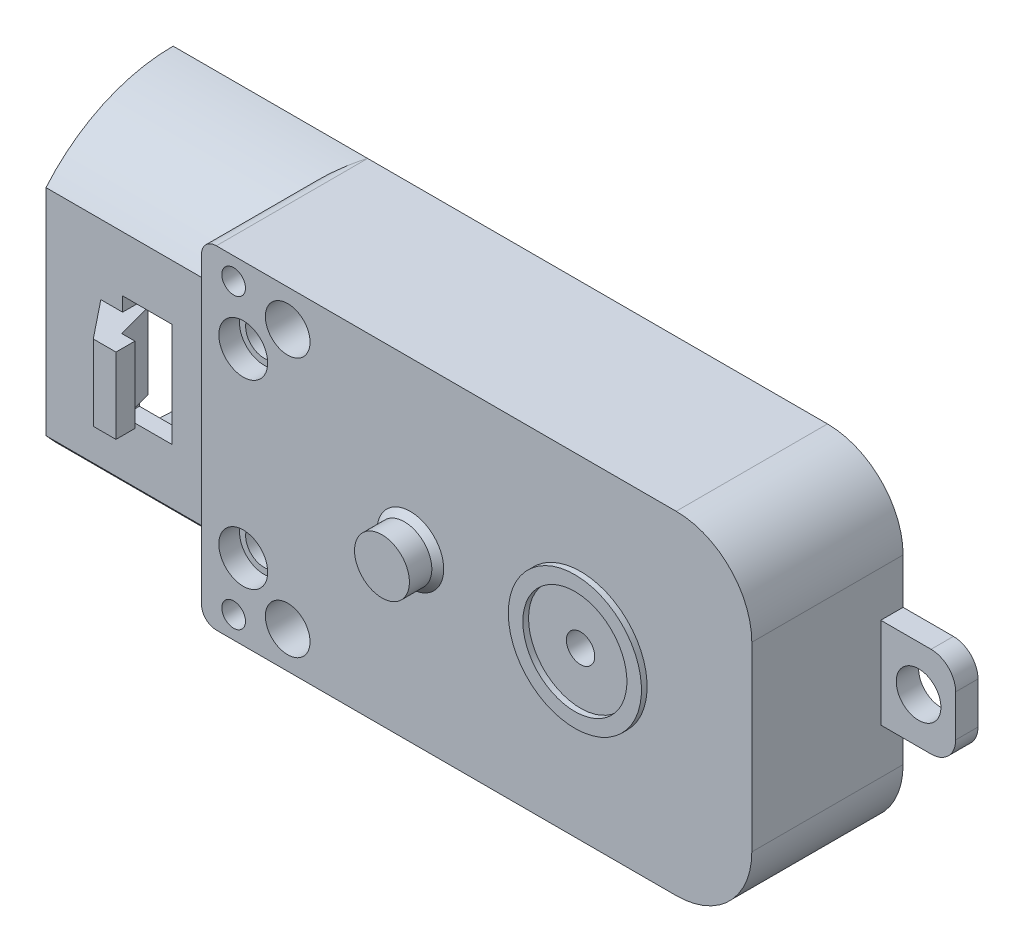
ISO-10303-21;
HEADER;
FILE_DESCRIPTION(('STEP AP214'),'2;1');
FILE_NAME('part.step','',(''),(''),'','','');
FILE_SCHEMA(('AUTOMOTIVE_DESIGN { 1 0 10303 214 1 1 1 1 }'));
ENDSEC;
DATA;
#1=APPLICATION_CONTEXT('core data for automotive mechanical design processes');
#2=APPLICATION_PROTOCOL_DEFINITION('international standard','automotive_design',2000,#1);
#3=PRODUCT_CONTEXT('',#1,'mechanical');
#4=PRODUCT('Part','Part','',(#3));
#5=PRODUCT_RELATED_PRODUCT_CATEGORY('part','',(#4));
#6=PRODUCT_DEFINITION_FORMATION('','',#4);
#7=PRODUCT_DEFINITION_CONTEXT('part definition',#1,'design');
#8=PRODUCT_DEFINITION('design','',#6,#7);
#9=PRODUCT_DEFINITION_SHAPE('','',#8);
#10=(LENGTH_UNIT() NAMED_UNIT(*) SI_UNIT(.MILLI.,.METRE.));
#11=(NAMED_UNIT(*) PLANE_ANGLE_UNIT() SI_UNIT($,.RADIAN.));
#12=(NAMED_UNIT(*) SI_UNIT($,.STERADIAN.) SOLID_ANGLE_UNIT());
#13=UNCERTAINTY_MEASURE_WITH_UNIT(LENGTH_MEASURE(1.E-05),#10,'distance_accuracy_value','');
#14=(GEOMETRIC_REPRESENTATION_CONTEXT(3) GLOBAL_UNCERTAINTY_ASSIGNED_CONTEXT((#13)) GLOBAL_UNIT_ASSIGNED_CONTEXT((#10,
#11,#12)) REPRESENTATION_CONTEXT('',''));
#15=CARTESIAN_POINT('',(0.,0.,0.));
#16=DIRECTION('',(0.,0.,1.));
#17=DIRECTION('',(1.,0.,0.));
#18=AXIS2_PLACEMENT_3D('',#15,#16,#17);
#19=CARTESIAN_POINT('',(11.5,11.176,10.16));
#20=DIRECTION('',(0.,0.,-1.));
#21=DIRECTION('',(-1.,0.,0.));
#22=AXIS2_PLACEMENT_3D('',#19,#20,#21);
#23=PLANE('',#22);
#24=CARTESIAN_POINT('',(-11.43,0.,10.16));
#25=DIRECTION('',(0.,0.,-1.));
#26=DIRECTION('',(-1.,0.,0.));
#27=AXIS2_PLACEMENT_3D('',#24,#25,#26);
#28=CIRCLE('',#27,2.2415);
#29=CARTESIAN_POINT('',(-13.6715,0.,10.16));
#30=VERTEX_POINT('',#29);
#31=EDGE_CURVE('E11',#30,#30,#28,.T.);
#32=ORIENTED_EDGE('',*,*,#31,.T.);
#33=EDGE_LOOP('',(#32));
#34=FACE_BOUND('',#33,.T.);
#35=CARTESIAN_POINT('',(-22.6503,-6.0833,10.16));
#36=DIRECTION('',(0.,0.,-1.));
#37=DIRECTION('',(1.,0.,0.));
#38=AXIS2_PLACEMENT_3D('',#35,#36,#37);
#39=CIRCLE('',#38,1.64035580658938);
#40=CARTESIAN_POINT('',(-21.0099441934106,-6.0833,10.16));
#41=VERTEX_POINT('',#40);
#42=EDGE_CURVE('E407',#41,#41,#39,.T.);
#43=ORIENTED_EDGE('',*,*,#42,.T.);
#44=EDGE_LOOP('',(#43));
#45=FACE_BOUND('',#44,.T.);
#46=CARTESIAN_POINT('',(-22.6503,6.0833,10.16));
#47=DIRECTION('',(0.,0.,1.));
#48=DIRECTION('',(1.,0.,0.));
#49=AXIS2_PLACEMENT_3D('',#46,#47,#48);
#50=CIRCLE('',#49,1.64035580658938);
#51=CARTESIAN_POINT('',(-21.0099441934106,6.0833,10.16));
#52=VERTEX_POINT('',#51);
#53=EDGE_CURVE('E424',#52,#52,#50,.T.);
#54=ORIENTED_EDGE('',*,*,#53,.F.);
#55=EDGE_LOOP('',(#54));
#56=FACE_BOUND('',#55,.T.);
#57=CARTESIAN_POINT('',(-23.295,-9.691,10.16));
#58=DIRECTION('',(0.,0.,-1.));
#59=DIRECTION('',(1.,0.,0.));
#60=AXIS2_PLACEMENT_3D('',#57,#58,#59);
#61=CIRCLE('',#60,0.795000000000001);
#62=CARTESIAN_POINT('',(-22.5,-9.691,10.16));
#63=VERTEX_POINT('',#62);
#64=EDGE_CURVE('E467',#63,#63,#61,.T.);
#65=ORIENTED_EDGE('',*,*,#64,.T.);
#66=EDGE_LOOP('',(#65));
#67=FACE_BOUND('',#66,.T.);
#68=CARTESIAN_POINT('',(-23.295,9.691,10.16));
#69=DIRECTION('',(0.,0.,1.));
#70=DIRECTION('',(1.,0.,0.));
#71=AXIS2_PLACEMENT_3D('',#68,#69,#70);
#72=CIRCLE('',#71,0.795000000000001);
#73=CARTESIAN_POINT('',(-22.5,9.691,10.16));
#74=VERTEX_POINT('',#73);
#75=EDGE_CURVE('E482',#74,#74,#72,.T.);
#76=ORIENTED_EDGE('',*,*,#75,.F.);
#77=EDGE_LOOP('',(#76));
#78=FACE_BOUND('',#77,.T.);
#79=CARTESIAN_POINT('',(-19.6658,8.7122,10.16));
#80=DIRECTION('',(0.,0.,1.));
#81=DIRECTION('',(1.,0.,0.));
#82=AXIS2_PLACEMENT_3D('',#79,#80,#81);
#83=CIRCLE('',#82,1.5);
#84=CARTESIAN_POINT('',(-18.1658,8.7122,10.16));
#85=VERTEX_POINT('',#84);
#86=EDGE_CURVE('E478',#85,#85,#83,.T.);
#87=ORIENTED_EDGE('',*,*,#86,.F.);
#88=EDGE_LOOP('',(#87));
#89=FACE_BOUND('',#88,.T.);
#90=CARTESIAN_POINT('',(-19.6658,-8.7122,10.16));
#91=DIRECTION('',(0.,0.,-1.));
#92=DIRECTION('',(1.,0.,0.));
#93=AXIS2_PLACEMENT_3D('',#90,#91,#92);
#94=CIRCLE('',#93,1.5);
#95=CARTESIAN_POINT('',(-18.1658,-8.7122,10.16));
#96=VERTEX_POINT('',#95);
#97=EDGE_CURVE('E463',#96,#96,#94,.T.);
#98=ORIENTED_EDGE('',*,*,#97,.T.);
#99=EDGE_LOOP('',(#98));
#100=FACE_BOUND('',#99,.T.);
#101=CARTESIAN_POINT('',(0.,0.,10.16));
#102=DIRECTION('',(0.,0.,-1.));
#103=DIRECTION('',(-1.,0.,0.));
#104=AXIS2_PLACEMENT_3D('',#101,#102,#103);
#105=CIRCLE('',#104,4.4704);
#106=CARTESIAN_POINT('',(-4.4704,0.,10.16));
#107=VERTEX_POINT('',#106);
#108=EDGE_CURVE('E541',#107,#107,#105,.F.);
#109=ORIENTED_EDGE('',*,*,#108,.F.);
#110=EDGE_LOOP('',(#109));
#111=FACE_BOUND('',#110,.T.);
#112=DIRECTION('',(0.,1.,0.));
#113=VECTOR('',#112,1.);
#114=CARTESIAN_POINT('',(-25.457,11.176,10.16));
#115=LINE('',#114,#113);
#116=CARTESIAN_POINT('',(-25.457,-10.176,10.16));
#117=VERTEX_POINT('',#116);
#118=CARTESIAN_POINT('',(-25.457,10.176,10.16));
#119=VERTEX_POINT('',#118);
#120=EDGE_CURVE('E450',#117,#119,#115,.T.);
#121=ORIENTED_EDGE('',*,*,#120,.F.);
#122=CARTESIAN_POINT('',(-24.457,-10.176,10.16));
#123=DIRECTION('',(0.,0.,-1.));
#124=DIRECTION('',(-1.,0.,0.));
#125=AXIS2_PLACEMENT_3D('',#122,#123,#124);
#126=CIRCLE('',#125,1.);
#127=CARTESIAN_POINT('',(-24.457,-11.176,10.16));
#128=VERTEX_POINT('',#127);
#129=EDGE_CURVE('E552',#117,#128,#126,.F.);
#130=ORIENTED_EDGE('',*,*,#129,.T.);
#131=DIRECTION('',(1.,0.,0.));
#132=VECTOR('',#131,1.);
#133=CARTESIAN_POINT('',(11.5,-11.176,10.16));
#134=LINE('',#133,#132);
#135=CARTESIAN_POINT('',(6.42,-11.176,10.16));
#136=VERTEX_POINT('',#135);
#137=EDGE_CURVE('E507',#128,#136,#134,.T.);
#138=ORIENTED_EDGE('',*,*,#137,.T.);
#139=CARTESIAN_POINT('',(6.42,-6.096,10.16));
#140=DIRECTION('',(0.,0.,-1.));
#141=DIRECTION('',(-1.,0.,0.));
#142=AXIS2_PLACEMENT_3D('',#139,#140,#141);
#143=CIRCLE('',#142,5.08);
#144=CARTESIAN_POINT('',(11.5,-6.096,10.16));
#145=VERTEX_POINT('',#144);
#146=EDGE_CURVE('E536',#136,#145,#143,.F.);
#147=ORIENTED_EDGE('',*,*,#146,.T.);
#148=DIRECTION('',(0.,1.,0.));
#149=VECTOR('',#148,1.);
#150=CARTESIAN_POINT('',(11.5,11.176,10.16));
#151=LINE('',#150,#149);
#152=CARTESIAN_POINT('',(11.5,6.096,10.16));
#153=VERTEX_POINT('',#152);
#154=EDGE_CURVE('E500',#145,#153,#151,.T.);
#155=ORIENTED_EDGE('',*,*,#154,.T.);
#156=CARTESIAN_POINT('',(6.42,6.096,10.16));
#157=DIRECTION('',(0.,0.,-1.));
#158=DIRECTION('',(-1.,0.,0.));
#159=AXIS2_PLACEMENT_3D('',#156,#157,#158);
#160=CIRCLE('',#159,5.08);
#161=CARTESIAN_POINT('',(6.42,11.176,10.16));
#162=VERTEX_POINT('',#161);
#163=EDGE_CURVE('E534',#153,#162,#160,.F.);
#164=ORIENTED_EDGE('',*,*,#163,.T.);
#165=DIRECTION('',(-1.,0.,0.));
#166=VECTOR('',#165,1.);
#167=CARTESIAN_POINT('',(11.5,11.176,10.16));
#168=LINE('',#167,#166);
#169=CARTESIAN_POINT('',(-24.457,11.176,10.16));
#170=VERTEX_POINT('',#169);
#171=EDGE_CURVE('E503',#162,#170,#168,.T.);
#172=ORIENTED_EDGE('',*,*,#171,.T.);
#173=CARTESIAN_POINT('',(-24.457,10.176,10.16));
#174=DIRECTION('',(0.,0.,-1.));
#175=DIRECTION('',(-1.,0.,0.));
#176=AXIS2_PLACEMENT_3D('',#173,#174,#175);
#177=CIRCLE('',#176,1.);
#178=EDGE_CURVE('E550',#170,#119,#177,.F.);
#179=ORIENTED_EDGE('',*,*,#178,.T.);
#180=EDGE_LOOP('',(#121,#130,#138,#147,#155,#164,#172,#179));
#181=FACE_BOUND('',#180,.T.);
#182=ADVANCED_FACE('F32',(#34,#45,#56,#67,#78,#89,#100,#111,#181),#23,.F.);
#183=CARTESIAN_POINT('',(-32.3785,3.4925,-1.4656));
#184=DIRECTION('',(-1.,0.,0.));
#185=DIRECTION('',(0.,-1.,0.));
#186=AXIS2_PLACEMENT_3D('',#183,#184,#185);
#187=PLANE('',#186);
#188=DIRECTION('',(0.,0.,-1.));
#189=VECTOR('',#188,1.);
#190=CARTESIAN_POINT('',(-32.3785,2.54,7.4044));
#191=LINE('',#190,#189);
#192=CARTESIAN_POINT('',(-32.3785,2.54,8.5344));
#193=VERTEX_POINT('',#192);
#194=CARTESIAN_POINT('',(-32.3785,2.54,7.4044));
#195=VERTEX_POINT('',#194);
#196=EDGE_CURVE('E323',#193,#195,#191,.T.);
#197=ORIENTED_EDGE('',*,*,#196,.T.);
#198=DIRECTION('',(0.,1.,0.));
#199=VECTOR('',#198,1.);
#200=CARTESIAN_POINT('',(-32.3785,3.4925,7.4044));
#201=LINE('',#200,#199);
#202=CARTESIAN_POINT('',(-32.3785,3.4925,7.4044));
#203=VERTEX_POINT('',#202);
#204=EDGE_CURVE('E376',#195,#203,#201,.T.);
#205=ORIENTED_EDGE('',*,*,#204,.T.);
#206=DIRECTION('',(0.,0.,1.));
#207=VECTOR('',#206,1.);
#208=CARTESIAN_POINT('',(-32.3785,3.4925,-1.4656));
#209=LINE('',#208,#207);
#210=CARTESIAN_POINT('',(-32.3785,3.4925,8.5344));
#211=VERTEX_POINT('',#210);
#212=EDGE_CURVE('E411',#203,#211,#209,.T.);
#213=ORIENTED_EDGE('',*,*,#212,.T.);
#214=DIRECTION('',(0.,-1.,0.));
#215=VECTOR('',#214,1.);
#216=CARTESIAN_POINT('',(-32.3785,3.4925,8.5344));
#217=LINE('',#216,#215);
#218=EDGE_CURVE('E398',#211,#193,#217,.T.);
#219=ORIENTED_EDGE('',*,*,#218,.T.);
#220=EDGE_LOOP('',(#197,#205,#213,#219));
#221=FACE_BOUND('',#220,.T.);
#222=ADVANCED_FACE('F622',(#221),#187,.F.);
#223=CARTESIAN_POINT('',(-22.6503,-6.0833,0.));
#224=DIRECTION('',(0.,0.,1.));
#225=DIRECTION('',(1.,0.,0.));
#226=AXIS2_PLACEMENT_3D('',#223,#224,#225);
#227=CYLINDRICAL_SURFACE('',#226,1.2319);
#228=CARTESIAN_POINT('',(-22.6503,-6.0833,0.));
#229=DIRECTION('',(0.,0.,-1.));
#230=DIRECTION('',(1.,0.,0.));
#231=AXIS2_PLACEMENT_3D('',#228,#229,#230);
#232=CIRCLE('',#231,1.2319);
#233=CARTESIAN_POINT('',(-21.4184,-6.0833,0.));
#234=VERTEX_POINT('',#233);
#235=EDGE_CURVE('E473',#234,#234,#232,.T.);
#236=ORIENTED_EDGE('',*,*,#235,.T.);
#237=EDGE_LOOP('',(#236));
#238=FACE_BOUND('',#237,.T.);
#239=CARTESIAN_POINT('',(-22.6503,-6.0833,8.77));
#240=DIRECTION('',(0.,0.,1.));
#241=DIRECTION('',(1.,0.,0.));
#242=AXIS2_PLACEMENT_3D('',#239,#240,#241);
#243=CIRCLE('',#242,1.2319);
#244=CARTESIAN_POINT('',(-21.4184,-6.0833,8.77));
#245=VERTEX_POINT('',#244);
#246=EDGE_CURVE('E417',#245,#245,#243,.T.);
#247=ORIENTED_EDGE('',*,*,#246,.T.);
#248=EDGE_LOOP('',(#247));
#249=FACE_BOUND('',#248,.T.);
#250=ADVANCED_FACE('F618',(#238,#249),#227,.F.);
#251=CARTESIAN_POINT('',(-22.6503,6.0833,0.));
#252=DIRECTION('',(0.,0.,1.));
#253=DIRECTION('',(1.,0.,0.));
#254=AXIS2_PLACEMENT_3D('',#251,#252,#253);
#255=CYLINDRICAL_SURFACE('',#254,1.2319);
#256=CARTESIAN_POINT('',(-22.6503,6.0833,0.));
#257=DIRECTION('',(0.,0.,1.));
#258=DIRECTION('',(1.,0.,0.));
#259=AXIS2_PLACEMENT_3D('',#256,#257,#258);
#260=CIRCLE('',#259,1.2319);
#261=CARTESIAN_POINT('',(-21.4184,6.0833,0.));
#262=VERTEX_POINT('',#261);
#263=EDGE_CURVE('E488',#262,#262,#260,.T.);
#264=ORIENTED_EDGE('',*,*,#263,.F.);
#265=EDGE_LOOP('',(#264));
#266=FACE_BOUND('',#265,.T.);
#267=CARTESIAN_POINT('',(-22.6503,6.0833,8.77));
#268=DIRECTION('',(0.,0.,1.));
#269=DIRECTION('',(1.,0.,0.));
#270=AXIS2_PLACEMENT_3D('',#267,#268,#269);
#271=CIRCLE('',#270,1.2319);
#272=CARTESIAN_POINT('',(-21.4184,6.0833,8.77));
#273=VERTEX_POINT('',#272);
#274=EDGE_CURVE('E423',#273,#273,#271,.F.);
#275=ORIENTED_EDGE('',*,*,#274,.F.);
#276=EDGE_LOOP('',(#275));
#277=FACE_BOUND('',#276,.T.);
#278=ADVANCED_FACE('F621',(#266,#277),#255,.F.);
#279=CARTESIAN_POINT('',(11.5,-11.176,10.16));
#280=DIRECTION('',(0.,1.,0.));
#281=DIRECTION('',(-1.,0.,0.));
#282=AXIS2_PLACEMENT_3D('',#279,#280,#281);
#283=PLANE('',#282);
#284=ORIENTED_EDGE('',*,*,#137,.F.);
#285=DIRECTION('',(0.,0.,1.));
#286=VECTOR('',#285,1.);
#287=CARTESIAN_POINT('',(-24.457,-11.176,0.));
#288=LINE('',#287,#286);
#289=CARTESIAN_POINT('',(-24.457,-11.176,0.));
#290=VERTEX_POINT('',#289);
#291=EDGE_CURVE('E554',#128,#290,#288,.F.);
#292=ORIENTED_EDGE('',*,*,#291,.T.);
#293=DIRECTION('',(1.,0.,0.));
#294=VECTOR('',#293,1.);
#295=CARTESIAN_POINT('',(11.5,-11.176,0.));
#296=LINE('',#295,#294);
#297=CARTESIAN_POINT('',(6.42,-11.176,0.));
#298=VERTEX_POINT('',#297);
#299=EDGE_CURVE('E519',#290,#298,#296,.T.);
#300=ORIENTED_EDGE('',*,*,#299,.T.);
#301=DIRECTION('',(0.,0.,-1.));
#302=VECTOR('',#301,1.);
#303=CARTESIAN_POINT('',(6.42,-11.176,10.16));
#304=LINE('',#303,#302);
#305=EDGE_CURVE('E531',#298,#136,#304,.F.);
#306=ORIENTED_EDGE('',*,*,#305,.T.);
#307=EDGE_LOOP('',(#284,#292,#300,#306));
#308=FACE_BOUND('',#307,.T.);
#309=ADVANCED_FACE('F634',(#308),#283,.F.);
#310=CARTESIAN_POINT('',(11.5,11.176,10.16));
#311=DIRECTION('',(0.,-1.,0.));
#312=DIRECTION('',(1.,0.,0.));
#313=AXIS2_PLACEMENT_3D('',#310,#311,#312);
#314=PLANE('',#313);
#315=DIRECTION('',(-1.,0.,0.));
#316=VECTOR('',#315,1.);
#317=CARTESIAN_POINT('',(11.5,11.176,0.));
#318=LINE('',#317,#316);
#319=CARTESIAN_POINT('',(6.42,11.176,0.));
#320=VERTEX_POINT('',#319);
#321=CARTESIAN_POINT('',(-24.457,11.176,0.));
#322=VERTEX_POINT('',#321);
#323=EDGE_CURVE('E512',#320,#322,#318,.T.);
#324=ORIENTED_EDGE('',*,*,#323,.T.);
#325=DIRECTION('',(0.,0.,-1.));
#326=VECTOR('',#325,1.);
#327=CARTESIAN_POINT('',(-24.457,11.176,10.16));
#328=LINE('',#327,#326);
#329=EDGE_CURVE('E557',#322,#170,#328,.F.);
#330=ORIENTED_EDGE('',*,*,#329,.T.);
#331=ORIENTED_EDGE('',*,*,#171,.F.);
#332=DIRECTION('',(0.,0.,-1.));
#333=VECTOR('',#332,1.);
#334=CARTESIAN_POINT('',(6.42,11.176,10.16));
#335=LINE('',#334,#333);
#336=EDGE_CURVE('E538',#162,#320,#335,.T.);
#337=ORIENTED_EDGE('',*,*,#336,.T.);
#338=EDGE_LOOP('',(#324,#330,#331,#337));
#339=FACE_BOUND('',#338,.T.);
#340=ADVANCED_FACE('F651',(#339),#314,.F.);
#341=CARTESIAN_POINT('',(-37.522,11.176,10.16));
#342=DIRECTION('',(1.,0.,0.));
#343=DIRECTION('',(0.,0.,-1.));
#344=AXIS2_PLACEMENT_3D('',#341,#342,#343);
#345=PLANE('',#344);
#346=DIRECTION('',(0.,-1.,0.));
#347=VECTOR('',#346,1.);
#348=CARTESIAN_POINT('',(-37.522,11.176,0.));
#349=LINE('',#348,#347);
#350=CARTESIAN_POINT('',(-37.522,11.176,0.));
#351=VERTEX_POINT('',#350);
#352=CARTESIAN_POINT('',(-37.522,10.046,0.));
#353=VERTEX_POINT('',#352);
#354=EDGE_CURVE('E516',#351,#353,#349,.T.);
#355=ORIENTED_EDGE('',*,*,#354,.T.);
#356=CARTESIAN_POINT('',(-37.522,0.,0.));
#357=DIRECTION('',(-1.,0.,0.));
#358=DIRECTION('',(0.,0.,1.));
#359=AXIS2_PLACEMENT_3D('',#356,#357,#358);
#360=CIRCLE('',#359,10.046);
#361=CARTESIAN_POINT('',(-37.522,6.78947543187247,7.4044));
#362=VERTEX_POINT('',#361);
#363=EDGE_CURVE('E354',#362,#353,#360,.T.);
#364=ORIENTED_EDGE('',*,*,#363,.F.);
#365=DIRECTION('',(0.,1.,0.));
#366=VECTOR('',#365,1.);
#367=CARTESIAN_POINT('',(-37.522,-6.78947543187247,7.4044));
#368=LINE('',#367,#366);
#369=CARTESIAN_POINT('',(-37.522,-6.78947543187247,7.4044));
#370=VERTEX_POINT('',#369);
#371=EDGE_CURVE('E358',#370,#362,#368,.T.);
#372=ORIENTED_EDGE('',*,*,#371,.F.);
#373=CARTESIAN_POINT('',(-37.522,0.,0.));
#374=DIRECTION('',(-1.,0.,0.));
#375=DIRECTION('',(0.,0.,1.));
#376=AXIS2_PLACEMENT_3D('',#373,#374,#375);
#377=CIRCLE('',#376,10.046);
#378=CARTESIAN_POINT('',(-37.522,-10.046,0.));
#379=VERTEX_POINT('',#378);
#380=EDGE_CURVE('E369',#379,#370,#377,.T.);
#381=ORIENTED_EDGE('',*,*,#380,.F.);
#382=CARTESIAN_POINT('',(-37.522,-11.176,0.));
#383=VERTEX_POINT('',#382);
#384=EDGE_CURVE('E515',#379,#383,#349,.T.);
#385=ORIENTED_EDGE('',*,*,#384,.T.);
#386=CARTESIAN_POINT('',(-37.522,0.,0.));
#387=DIRECTION('',(1.,0.,0.));
#388=DIRECTION('',(0.,0.,1.));
#389=AXIS2_PLACEMENT_3D('',#386,#387,#388);
#390=CIRCLE('',#389,11.176);
#391=CARTESIAN_POINT('',(-37.522,-7.21574615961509,8.5344));
#392=VERTEX_POINT('',#391);
#393=EDGE_CURVE('E431',#392,#383,#390,.T.);
#394=ORIENTED_EDGE('',*,*,#393,.F.);
#395=DIRECTION('',(0.,1.,0.));
#396=VECTOR('',#395,1.);
#397=CARTESIAN_POINT('',(-37.522,7.21574615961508,8.5344));
#398=LINE('',#397,#396);
#399=CARTESIAN_POINT('',(-37.522,7.21574615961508,8.5344));
#400=VERTEX_POINT('',#399);
#401=EDGE_CURVE('E441',#392,#400,#398,.T.);
#402=ORIENTED_EDGE('',*,*,#401,.T.);
#403=CARTESIAN_POINT('',(-37.522,0.,0.));
#404=DIRECTION('',(-1.,0.,0.));
#405=DIRECTION('',(0.,0.,1.));
#406=AXIS2_PLACEMENT_3D('',#403,#404,#405);
#407=CIRCLE('',#406,11.176);
#408=EDGE_CURVE('E436',#400,#351,#407,.T.);
#409=ORIENTED_EDGE('',*,*,#408,.T.);
#410=EDGE_LOOP('',(#355,#364,#372,#381,#385,#394,#402,#409));
#411=FACE_BOUND('',#410,.T.);
#412=ADVANCED_FACE('F644',(#411),#345,.F.);
#413=CARTESIAN_POINT('',(0.,0.,10.16));
#414=DIRECTION('',(0.,0.,1.));
#415=DIRECTION('',(1.,0.,0.));
#416=AXIS2_PLACEMENT_3D('',#413,#414,#415);
#417=CIRCLE('',#416,3.4925);
#418=CARTESIAN_POINT('',(-3.4925,0.,10.16));
#419=VERTEX_POINT('',#418);
#420=EDGE_CURVE('E454',#419,#419,#417,.T.);
#421=ORIENTED_EDGE('',*,*,#420,.T.);
#422=EDGE_LOOP('',(#421));
#423=FACE_BOUND('',#422,.T.);
#424=CARTESIAN_POINT('',(0.,0.,10.16));
#425=DIRECTION('',(0.,0.,1.));
#426=DIRECTION('',(1.,0.,0.));
#427=AXIS2_PLACEMENT_3D('',#424,#425,#426);
#428=CIRCLE('',#427,0.9525);
#429=CARTESIAN_POINT('',(0.9525,0.,10.16));
#430=VERTEX_POINT('',#429);
#431=EDGE_CURVE('E493',#430,#430,#428,.T.);
#432=ORIENTED_EDGE('',*,*,#431,.F.);
#433=EDGE_LOOP('',(#432));
#434=FACE_BOUND('',#433,.T.);
#435=ADVANCED_FACE('F640',(#423,#434),#23,.F.);
#436=CARTESIAN_POINT('',(11.5,11.176,0.));
#437=DIRECTION('',(0.,0.,-1.));
#438=DIRECTION('',(-1.,0.,0.));
#439=AXIS2_PLACEMENT_3D('',#436,#437,#438);
#440=PLANE('',#439);
#441=DIRECTION('',(-1.,0.,0.));
#442=VECTOR('',#441,1.);
#443=CARTESIAN_POINT('',(-25.522,10.046,0.));
#444=LINE('',#443,#442);
#445=CARTESIAN_POINT('',(-25.522,10.046,0.));
#446=VERTEX_POINT('',#445);
#447=EDGE_CURVE('E367',#446,#353,#444,.T.);
#448=ORIENTED_EDGE('',*,*,#447,.T.);
#449=ORIENTED_EDGE('',*,*,#354,.F.);
#450=DIRECTION('',(-1.,0.,0.));
#451=VECTOR('',#450,1.);
#452=CARTESIAN_POINT('',(-25.457,11.176,0.));
#453=LINE('',#452,#451);
#454=EDGE_CURVE('E443',#322,#351,#453,.T.);
#455=ORIENTED_EDGE('',*,*,#454,.F.);
#456=ORIENTED_EDGE('',*,*,#323,.F.);
#457=CARTESIAN_POINT('',(6.42,6.096,0.));
#458=DIRECTION('',(0.,0.,-1.));
#459=DIRECTION('',(-1.,0.,0.));
#460=AXIS2_PLACEMENT_3D('',#457,#458,#459);
#461=CIRCLE('',#460,5.08);
#462=CARTESIAN_POINT('',(11.5,6.096,0.));
#463=VERTEX_POINT('',#462);
#464=EDGE_CURVE('E525',#320,#463,#461,.T.);
#465=ORIENTED_EDGE('',*,*,#464,.T.);
#466=DIRECTION('',(0.,1.,0.));
#467=VECTOR('',#466,1.);
#468=CARTESIAN_POINT('',(11.5,11.176,0.));
#469=LINE('',#468,#467);
#470=CARTESIAN_POINT('',(11.5,3.048,0.));
#471=VERTEX_POINT('',#470);
#472=EDGE_CURVE('E497',#471,#463,#469,.T.);
#473=ORIENTED_EDGE('',*,*,#472,.F.);
#474=DIRECTION('',(1.,0.,0.));
#475=VECTOR('',#474,1.);
#476=CARTESIAN_POINT('',(11.5,3.048,0.));
#477=LINE('',#476,#475);
#478=CARTESIAN_POINT('',(14.8782,3.048,0.));
#479=VERTEX_POINT('',#478);
#480=EDGE_CURVE('E281',#471,#479,#477,.T.);
#481=ORIENTED_EDGE('',*,*,#480,.T.);
#482=CARTESIAN_POINT('',(14.8782,1.397,0.));
#483=DIRECTION('',(0.,0.,-1.));
#484=DIRECTION('',(-1.,0.,0.));
#485=AXIS2_PLACEMENT_3D('',#482,#483,#484);
#486=CIRCLE('',#485,1.651);
#487=CARTESIAN_POINT('',(16.5292,1.397,0.));
#488=VERTEX_POINT('',#487);
#489=EDGE_CURVE('E251',#479,#488,#486,.T.);
#490=ORIENTED_EDGE('',*,*,#489,.T.);
#491=DIRECTION('',(0.,-1.,0.));
#492=VECTOR('',#491,1.);
#493=CARTESIAN_POINT('',(16.5292,1.397,0.));
#494=LINE('',#493,#492);
#495=CARTESIAN_POINT('',(16.5292,-1.397,0.));
#496=VERTEX_POINT('',#495);
#497=EDGE_CURVE('E285',#488,#496,#494,.T.);
#498=ORIENTED_EDGE('',*,*,#497,.T.);
#499=CARTESIAN_POINT('',(14.8782,-1.397,0.));
#500=DIRECTION('',(0.,0.,-1.));
#501=DIRECTION('',(1.,0.,0.));
#502=AXIS2_PLACEMENT_3D('',#499,#500,#501);
#503=CIRCLE('',#502,1.651);
#504=CARTESIAN_POINT('',(14.8782,-3.048,0.));
#505=VERTEX_POINT('',#504);
#506=EDGE_CURVE('E288',#496,#505,#503,.T.);
#507=ORIENTED_EDGE('',*,*,#506,.T.);
#508=DIRECTION('',(-1.,0.,0.));
#509=VECTOR('',#508,1.);
#510=CARTESIAN_POINT('',(11.5,-3.048,0.));
#511=LINE('',#510,#509);
#512=CARTESIAN_POINT('',(11.5,-3.048,0.));
#513=VERTEX_POINT('',#512);
#514=EDGE_CURVE('E270',#505,#513,#511,.T.);
#515=ORIENTED_EDGE('',*,*,#514,.T.);
#516=CARTESIAN_POINT('',(11.5,-6.096,0.));
#517=VERTEX_POINT('',#516);
#518=EDGE_CURVE('E510',#517,#513,#469,.T.);
#519=ORIENTED_EDGE('',*,*,#518,.F.);
#520=CARTESIAN_POINT('',(6.42,-6.096,0.));
#521=DIRECTION('',(0.,0.,-1.));
#522=DIRECTION('',(-1.,0.,0.));
#523=AXIS2_PLACEMENT_3D('',#520,#521,#522);
#524=CIRCLE('',#523,5.08);
#525=EDGE_CURVE('E528',#517,#298,#524,.T.);
#526=ORIENTED_EDGE('',*,*,#525,.T.);
#527=ORIENTED_EDGE('',*,*,#299,.F.);
#528=EDGE_CURVE('E504',#383,#290,#296,.T.);
#529=ORIENTED_EDGE('',*,*,#528,.F.);
#530=ORIENTED_EDGE('',*,*,#384,.F.);
#531=DIRECTION('',(-1.,0.,0.));
#532=VECTOR('',#531,1.);
#533=CARTESIAN_POINT('',(-25.522,-10.046,0.));
#534=LINE('',#533,#532);
#535=CARTESIAN_POINT('',(-25.522,-10.046,0.));
#536=VERTEX_POINT('',#535);
#537=EDGE_CURVE('E379',#536,#379,#534,.T.);
#538=ORIENTED_EDGE('',*,*,#537,.F.);
#539=DIRECTION('',(0.,-1.,0.));
#540=VECTOR('',#539,1.);
#541=CARTESIAN_POINT('',(-25.522,10.046,0.));
#542=LINE('',#541,#540);
#543=EDGE_CURVE('E357',#446,#536,#542,.T.);
#544=ORIENTED_EDGE('',*,*,#543,.F.);
#545=EDGE_LOOP('',(#448,#449,#455,#456,#465,#473,#481,#490,#498,#507,#515,#519,#526,#527,#529,
#530,#538,#544));
#546=FACE_BOUND('',#545,.T.);
#547=CARTESIAN_POINT('',(-23.295,-9.691,0.));
#548=DIRECTION('',(0.,0.,-1.));
#549=DIRECTION('',(1.,0.,0.));
#550=AXIS2_PLACEMENT_3D('',#547,#548,#549);
#551=CIRCLE('',#550,0.795000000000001);
#552=CARTESIAN_POINT('',(-22.5,-9.691,0.));
#553=VERTEX_POINT('',#552);
#554=EDGE_CURVE('E470',#553,#553,#551,.T.);
#555=ORIENTED_EDGE('',*,*,#554,.F.);
#556=EDGE_LOOP('',(#555));
#557=FACE_BOUND('',#556,.T.);
#558=CARTESIAN_POINT('',(0.,0.,0.));
#559=DIRECTION('',(0.,0.,1.));
#560=DIRECTION('',(1.,0.,0.));
#561=AXIS2_PLACEMENT_3D('',#558,#559,#560);
#562=CIRCLE('',#561,0.9525);
#563=CARTESIAN_POINT('',(0.9525,0.,0.));
#564=VERTEX_POINT('',#563);
#565=EDGE_CURVE('E494',#564,#564,#562,.T.);
#566=ORIENTED_EDGE('',*,*,#565,.T.);
#567=EDGE_LOOP('',(#566));
#568=FACE_BOUND('',#567,.T.);
#569=ORIENTED_EDGE('',*,*,#263,.T.);
#570=EDGE_LOOP('',(#569));
#571=FACE_BOUND('',#570,.T.);
#572=CARTESIAN_POINT('',(-23.295,9.691,0.));
#573=DIRECTION('',(0.,0.,1.));
#574=DIRECTION('',(1.,0.,0.));
#575=AXIS2_PLACEMENT_3D('',#572,#573,#574);
#576=CIRCLE('',#575,0.795000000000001);
#577=CARTESIAN_POINT('',(-22.5,9.691,0.));
#578=VERTEX_POINT('',#577);
#579=EDGE_CURVE('E485',#578,#578,#576,.T.);
#580=ORIENTED_EDGE('',*,*,#579,.T.);
#581=EDGE_LOOP('',(#580));
#582=FACE_BOUND('',#581,.T.);
#583=CARTESIAN_POINT('',(-19.6658,8.7122,0.));
#584=DIRECTION('',(0.,0.,1.));
#585=DIRECTION('',(1.,0.,0.));
#586=AXIS2_PLACEMENT_3D('',#583,#584,#585);
#587=CIRCLE('',#586,1.5);
#588=CARTESIAN_POINT('',(-18.1658,8.7122,0.));
#589=VERTEX_POINT('',#588);
#590=EDGE_CURVE('E479',#589,#589,#587,.T.);
#591=ORIENTED_EDGE('',*,*,#590,.T.);
#592=EDGE_LOOP('',(#591));
#593=FACE_BOUND('',#592,.T.);
#594=ORIENTED_EDGE('',*,*,#235,.F.);
#595=EDGE_LOOP('',(#594));
#596=FACE_BOUND('',#595,.T.);
#597=CARTESIAN_POINT('',(-19.6658,-8.7122,0.));
#598=DIRECTION('',(0.,0.,-1.));
#599=DIRECTION('',(1.,0.,0.));
#600=AXIS2_PLACEMENT_3D('',#597,#598,#599);
#601=CIRCLE('',#600,1.5);
#602=CARTESIAN_POINT('',(-18.1658,-8.7122,0.));
#603=VERTEX_POINT('',#602);
#604=EDGE_CURVE('E464',#603,#603,#601,.T.);
#605=ORIENTED_EDGE('',*,*,#604,.F.);
#606=EDGE_LOOP('',(#605));
#607=FACE_BOUND('',#606,.T.);
#608=CARTESIAN_POINT('',(14.04,0.,0.));
#609=DIRECTION('',(0.,0.,-1.));
#610=DIRECTION('',(-1.,0.,0.));
#611=AXIS2_PLACEMENT_3D('',#608,#609,#610);
#612=CIRCLE('',#611,1.5);
#613=CARTESIAN_POINT('',(12.54,0.,0.));
#614=VERTEX_POINT('',#613);
#615=EDGE_CURVE('E828',#614,#614,#612,.T.);
#616=ORIENTED_EDGE('',*,*,#615,.F.);
#617=EDGE_LOOP('',(#616));
#618=FACE_BOUND('',#617,.T.);
#619=ADVANCED_FACE('F643',(#546,#557,#568,#571,#582,#593,#596,#607,#618),#440,.T.);
#620=CARTESIAN_POINT('',(11.5,11.176,10.16));
#621=DIRECTION('',(-1.,0.,0.));
#622=DIRECTION('',(0.,-1.,0.));
#623=AXIS2_PLACEMENT_3D('',#620,#621,#622);
#624=PLANE('',#623);
#625=ORIENTED_EDGE('',*,*,#518,.T.);
#626=DIRECTION('',(0.,0.,-1.));
#627=VECTOR('',#626,1.);
#628=CARTESIAN_POINT('',(11.5,-3.048,1.5));
#629=LINE('',#628,#627);
#630=CARTESIAN_POINT('',(11.5,-3.048,1.5));
#631=VERTEX_POINT('',#630);
#632=EDGE_CURVE('E52',#631,#513,#629,.T.);
#633=ORIENTED_EDGE('',*,*,#632,.F.);
#634=DIRECTION('',(0.,1.,0.));
#635=VECTOR('',#634,1.);
#636=CARTESIAN_POINT('',(11.5,3.048,1.5));
#637=LINE('',#636,#635);
#638=CARTESIAN_POINT('',(11.5,3.048,1.5));
#639=VERTEX_POINT('',#638);
#640=EDGE_CURVE('E47',#631,#639,#637,.T.);
#641=ORIENTED_EDGE('',*,*,#640,.T.);
#642=DIRECTION('',(0.,0.,-1.));
#643=VECTOR('',#642,1.);
#644=CARTESIAN_POINT('',(11.5,3.048,1.5));
#645=LINE('',#644,#643);
#646=EDGE_CURVE('E257',#639,#471,#645,.T.);
#647=ORIENTED_EDGE('',*,*,#646,.T.);
#648=ORIENTED_EDGE('',*,*,#472,.T.);
#649=DIRECTION('',(0.,0.,-1.));
#650=VECTOR('',#649,1.);
#651=CARTESIAN_POINT('',(11.5,6.096,10.16));
#652=LINE('',#651,#650);
#653=EDGE_CURVE('E509',#463,#153,#652,.F.);
#654=ORIENTED_EDGE('',*,*,#653,.T.);
#655=ORIENTED_EDGE('',*,*,#154,.F.);
#656=DIRECTION('',(0.,0.,-1.));
#657=VECTOR('',#656,1.);
#658=CARTESIAN_POINT('',(11.5,-6.096,10.16));
#659=LINE('',#658,#657);
#660=EDGE_CURVE('E522',#145,#517,#659,.T.);
#661=ORIENTED_EDGE('',*,*,#660,.T.);
#662=EDGE_LOOP('',(#625,#633,#641,#647,#648,#654,#655,#661));
#663=FACE_BOUND('',#662,.T.);
#664=ADVANCED_FACE('F638',(#663),#624,.F.);
#665=CARTESIAN_POINT('',(0.,0.,0.));
#666=DIRECTION('',(0.,0.,1.));
#667=DIRECTION('',(1.,0.,0.));
#668=AXIS2_PLACEMENT_3D('',#665,#666,#667);
#669=CYLINDRICAL_SURFACE('',#668,0.9525);
#670=ORIENTED_EDGE('',*,*,#565,.F.);
#671=EDGE_LOOP('',(#670));
#672=FACE_BOUND('',#671,.T.);
#673=ORIENTED_EDGE('',*,*,#431,.T.);
#674=EDGE_LOOP('',(#673));
#675=FACE_BOUND('',#674,.T.);
#676=ADVANCED_FACE('F630',(#672,#675),#669,.F.);
#677=CARTESIAN_POINT('',(-23.295,9.691,0.));
#678=DIRECTION('',(0.,0.,1.));
#679=DIRECTION('',(1.,0.,0.));
#680=AXIS2_PLACEMENT_3D('',#677,#678,#679);
#681=CYLINDRICAL_SURFACE('',#680,0.795000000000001);
#682=ORIENTED_EDGE('',*,*,#579,.F.);
#683=EDGE_LOOP('',(#682));
#684=FACE_BOUND('',#683,.T.);
#685=ORIENTED_EDGE('',*,*,#75,.T.);
#686=EDGE_LOOP('',(#685));
#687=FACE_BOUND('',#686,.T.);
#688=ADVANCED_FACE('F626',(#684,#687),#681,.F.);
#689=CARTESIAN_POINT('',(-19.6658,8.7122,0.));
#690=DIRECTION('',(0.,0.,1.));
#691=DIRECTION('',(1.,0.,0.));
#692=AXIS2_PLACEMENT_3D('',#689,#690,#691);
#693=CYLINDRICAL_SURFACE('',#692,1.5);
#694=ORIENTED_EDGE('',*,*,#590,.F.);
#695=EDGE_LOOP('',(#694));
#696=FACE_BOUND('',#695,.T.);
#697=ORIENTED_EDGE('',*,*,#86,.T.);
#698=EDGE_LOOP('',(#697));
#699=FACE_BOUND('',#698,.T.);
#700=ADVANCED_FACE('F616',(#696,#699),#693,.F.);
#701=CARTESIAN_POINT('',(-23.295,-9.691,0.));
#702=DIRECTION('',(0.,0.,1.));
#703=DIRECTION('',(1.,0.,0.));
#704=AXIS2_PLACEMENT_3D('',#701,#702,#703);
#705=CYLINDRICAL_SURFACE('',#704,0.795000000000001);
#706=ORIENTED_EDGE('',*,*,#554,.T.);
#707=EDGE_LOOP('',(#706));
#708=FACE_BOUND('',#707,.T.);
#709=ORIENTED_EDGE('',*,*,#64,.F.);
#710=EDGE_LOOP('',(#709));
#711=FACE_BOUND('',#710,.T.);
#712=ADVANCED_FACE('F612',(#708,#711),#705,.F.);
#713=CARTESIAN_POINT('',(-19.6658,-8.7122,0.));
#714=DIRECTION('',(0.,0.,1.));
#715=DIRECTION('',(1.,0.,0.));
#716=AXIS2_PLACEMENT_3D('',#713,#714,#715);
#717=CYLINDRICAL_SURFACE('',#716,1.5);
#718=ORIENTED_EDGE('',*,*,#604,.T.);
#719=EDGE_LOOP('',(#718));
#720=FACE_BOUND('',#719,.T.);
#721=ORIENTED_EDGE('',*,*,#97,.F.);
#722=EDGE_LOOP('',(#721));
#723=FACE_BOUND('',#722,.T.);
#724=ADVANCED_FACE('F608',(#720,#723),#717,.F.);
#725=CARTESIAN_POINT('',(6.42,-6.096,10.16));
#726=DIRECTION('',(0.,0.,-1.));
#727=DIRECTION('',(-1.,0.,0.));
#728=AXIS2_PLACEMENT_3D('',#725,#726,#727);
#729=CYLINDRICAL_SURFACE('',#728,5.08);
#730=ORIENTED_EDGE('',*,*,#146,.F.);
#731=ORIENTED_EDGE('',*,*,#305,.F.);
#732=ORIENTED_EDGE('',*,*,#525,.F.);
#733=ORIENTED_EDGE('',*,*,#660,.F.);
#734=EDGE_LOOP('',(#730,#731,#732,#733));
#735=FACE_BOUND('',#734,.T.);
#736=ADVANCED_FACE('F611',(#735),#729,.T.);
#737=CARTESIAN_POINT('',(6.42,6.096,10.16));
#738=DIRECTION('',(0.,0.,-1.));
#739=DIRECTION('',(-1.,0.,0.));
#740=AXIS2_PLACEMENT_3D('',#737,#738,#739);
#741=CYLINDRICAL_SURFACE('',#740,5.08);
#742=ORIENTED_EDGE('',*,*,#163,.F.);
#743=ORIENTED_EDGE('',*,*,#653,.F.);
#744=ORIENTED_EDGE('',*,*,#464,.F.);
#745=ORIENTED_EDGE('',*,*,#336,.F.);
#746=EDGE_LOOP('',(#742,#743,#744,#745));
#747=FACE_BOUND('',#746,.T.);
#748=ADVANCED_FACE('F603',(#747),#741,.T.);
#749=CARTESIAN_POINT('',(0.,0.,10.541));
#750=DIRECTION('',(0.,0.,1.));
#751=DIRECTION('',(1.,0.,0.));
#752=AXIS2_PLACEMENT_3D('',#749,#750,#751);
#753=PLANE('',#752);
#754=CARTESIAN_POINT('',(0.,0.,10.541));
#755=DIRECTION('',(0.,0.,1.));
#756=DIRECTION('',(1.,0.,0.));
#757=AXIS2_PLACEMENT_3D('',#754,#755,#756);
#758=CIRCLE('',#757,4.4704);
#759=CARTESIAN_POINT('',(-4.4704,0.,10.541));
#760=VERTEX_POINT('',#759);
#761=EDGE_CURVE('E458',#760,#760,#758,.T.);
#762=ORIENTED_EDGE('',*,*,#761,.T.);
#763=EDGE_LOOP('',(#762));
#764=FACE_BOUND('',#763,.T.);
#765=CARTESIAN_POINT('',(0.,0.,10.541));
#766=DIRECTION('',(0.,0.,1.));
#767=DIRECTION('',(1.,0.,0.));
#768=AXIS2_PLACEMENT_3D('',#765,#766,#767);
#769=CIRCLE('',#768,3.4925);
#770=CARTESIAN_POINT('',(-3.4925,0.,10.541));
#771=VERTEX_POINT('',#770);
#772=EDGE_CURVE('E455',#771,#771,#769,.T.);
#773=ORIENTED_EDGE('',*,*,#772,.F.);
#774=EDGE_LOOP('',(#773));
#775=FACE_BOUND('',#774,.T.);
#776=ADVANCED_FACE('F600',(#764,#775),#753,.T.);
#777=CARTESIAN_POINT('',(0.,0.,10.541));
#778=DIRECTION('',(0.,0.,-1.));
#779=DIRECTION('',(-1.,0.,0.));
#780=AXIS2_PLACEMENT_3D('',#777,#778,#779);
#781=CYLINDRICAL_SURFACE('',#780,4.4704);
#782=CARTESIAN_POINT('',(-4.4704,0.,10.541));
#783=CARTESIAN_POINT('',(-4.4704,0.,10.53703125));
#784=CARTESIAN_POINT('',(-4.4704,0.,10.5330625));
#785=CARTESIAN_POINT('',(-4.4704,0.,10.525125));
#786=CARTESIAN_POINT('',(-4.4704,0.,10.52115625));
#787=CARTESIAN_POINT('',(-4.4704,0.,10.51321875));
#788=CARTESIAN_POINT('',(-4.4704,0.,10.50925));
#789=CARTESIAN_POINT('',(-4.4704,0.,10.5013125));
#790=CARTESIAN_POINT('',(-4.4704,0.,10.49734375));
#791=CARTESIAN_POINT('',(-4.4704,0.,10.48940625));
#792=CARTESIAN_POINT('',(-4.4704,0.,10.4854375));
#793=CARTESIAN_POINT('',(-4.4704,0.,10.4775));
#794=CARTESIAN_POINT('',(-4.4704,0.,10.47353125));
#795=CARTESIAN_POINT('',(-4.4704,0.,10.46559375));
#796=CARTESIAN_POINT('',(-4.4704,0.,10.461625));
#797=CARTESIAN_POINT('',(-4.4704,0.,10.4536875));
#798=CARTESIAN_POINT('',(-4.4704,0.,10.44971875));
#799=CARTESIAN_POINT('',(-4.4704,0.,10.44178125));
#800=CARTESIAN_POINT('',(-4.4704,0.,10.4378125));
#801=CARTESIAN_POINT('',(-4.4704,0.,10.429875));
#802=CARTESIAN_POINT('',(-4.4704,0.,10.42590625));
#803=CARTESIAN_POINT('',(-4.4704,0.,10.41796875));
#804=CARTESIAN_POINT('',(-4.4704,0.,10.414));
#805=CARTESIAN_POINT('',(-4.4704,0.,10.4060625));
#806=CARTESIAN_POINT('',(-4.4704,0.,10.40209375));
#807=CARTESIAN_POINT('',(-4.4704,0.,10.39415625));
#808=CARTESIAN_POINT('',(-4.4704,0.,10.3901875));
#809=CARTESIAN_POINT('',(-4.4704,0.,10.38225));
#810=CARTESIAN_POINT('',(-4.4704,0.,10.37828125));
#811=CARTESIAN_POINT('',(-4.4704,0.,10.37034375));
#812=CARTESIAN_POINT('',(-4.4704,0.,10.366375));
#813=CARTESIAN_POINT('',(-4.4704,0.,10.3584375));
#814=CARTESIAN_POINT('',(-4.4704,0.,10.35446875));
#815=CARTESIAN_POINT('',(-4.4704,0.,10.34653125));
#816=CARTESIAN_POINT('',(-4.4704,0.,10.3425625));
#817=CARTESIAN_POINT('',(-4.4704,0.,10.334625));
#818=CARTESIAN_POINT('',(-4.4704,0.,10.33065625));
#819=CARTESIAN_POINT('',(-4.4704,0.,10.32271875));
#820=CARTESIAN_POINT('',(-4.4704,0.,10.31875));
#821=CARTESIAN_POINT('',(-4.4704,0.,10.3108125));
#822=CARTESIAN_POINT('',(-4.4704,0.,10.30684375));
#823=CARTESIAN_POINT('',(-4.4704,0.,10.29890625));
#824=CARTESIAN_POINT('',(-4.4704,0.,10.2949375));
#825=CARTESIAN_POINT('',(-4.4704,0.,10.287));
#826=CARTESIAN_POINT('',(-4.4704,0.,10.28303125));
#827=CARTESIAN_POINT('',(-4.4704,0.,10.27509375));
#828=CARTESIAN_POINT('',(-4.4704,0.,10.271125));
#829=CARTESIAN_POINT('',(-4.4704,0.,10.2631875));
#830=CARTESIAN_POINT('',(-4.4704,0.,10.25921875));
#831=CARTESIAN_POINT('',(-4.4704,0.,10.25128125));
#832=CARTESIAN_POINT('',(-4.4704,0.,10.2473125));
#833=CARTESIAN_POINT('',(-4.4704,0.,10.239375));
#834=CARTESIAN_POINT('',(-4.4704,0.,10.23540625));
#835=CARTESIAN_POINT('',(-4.4704,0.,10.22746875));
#836=CARTESIAN_POINT('',(-4.4704,0.,10.2235));
#837=CARTESIAN_POINT('',(-4.4704,0.,10.2155625));
#838=CARTESIAN_POINT('',(-4.4704,0.,10.21159375));
#839=CARTESIAN_POINT('',(-4.4704,0.,10.20365625));
#840=CARTESIAN_POINT('',(-4.4704,0.,10.1996875));
#841=CARTESIAN_POINT('',(-4.4704,0.,10.19175));
#842=CARTESIAN_POINT('',(-4.4704,0.,10.18778125));
#843=CARTESIAN_POINT('',(-4.4704,0.,10.17984375));
#844=CARTESIAN_POINT('',(-4.4704,0.,10.175875));
#845=CARTESIAN_POINT('',(-4.4704,0.,10.1679375));
#846=CARTESIAN_POINT('',(-4.4704,0.,10.16396875));
#847=CARTESIAN_POINT('',(-4.4704,0.,10.16));
#848=B_SPLINE_CURVE_WITH_KNOTS('',3,(#782,#783,#784,#785,#786,#787,#788,#789,#790,#791,#792,
#793,#794,#795,#796,#797,#798,#799,#800,#801,#802,#803,#804,#805,#806,#807,#808,#809,#810,#811,
#812,#813,#814,#815,#816,#817,#818,#819,#820,#821,#822,#823,#824,#825,#826,#827,#828,#829,#830,
#831,#832,#833,#834,#835,#836,#837,#838,#839,#840,#841,#842,#843,#844,#845,#846,#847),
.UNSPECIFIED.,.F.,.F.,(4,2,2,2,2,2,2,2,2,2,2,2,2,2,2,2,2,2,2,2,2,2,2,2,2,2,2,2,2,2,2,2,4),(0.,
0.0119062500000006,0.0238125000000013,0.0357187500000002,0.0476250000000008,0.0595312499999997,
0.0714375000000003,0.083343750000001,0.0952499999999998,0.10715625,0.119062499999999,0.13096875,
0.142875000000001,0.15478125,0.1666875,0.178593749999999,0.1905,0.20240625,0.214312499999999,
0.22621875,0.238124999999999,0.250031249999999,0.2619375,0.273843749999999,0.28575,
0.297656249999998,0.309562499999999,0.32146875,0.333374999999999,0.345281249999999,
0.357187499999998,0.369093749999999,0.380999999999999),.UNSPECIFIED.);
#849=EDGE_CURVE('BSEAM598',#760,#107,#848,.T.);
#850=ORIENTED_EDGE('',*,*,#761,.F.);
#851=ORIENTED_EDGE('',*,*,#108,.T.);
#852=ORIENTED_EDGE('',*,*,#849,.T.);
#853=ORIENTED_EDGE('',*,*,#849,.F.);
#854=EDGE_LOOP('',(#850,#852,#851,#853));
#855=FACE_BOUND('',#854,.T.);
#856=ADVANCED_FACE('F598',(#855),#781,.T.);
#857=CARTESIAN_POINT('',(0.,0.,10.541));
#858=DIRECTION('',(0.,0.,-1.));
#859=DIRECTION('',(-1.,0.,0.));
#860=AXIS2_PLACEMENT_3D('',#857,#858,#859);
#861=CYLINDRICAL_SURFACE('',#860,3.4925);
#862=CARTESIAN_POINT('',(-3.4925,0.,10.541));
#863=CARTESIAN_POINT('',(-3.4925,0.,10.53703125));
#864=CARTESIAN_POINT('',(-3.4925,0.,10.5330625));
#865=CARTESIAN_POINT('',(-3.4925,0.,10.525125));
#866=CARTESIAN_POINT('',(-3.4925,0.,10.52115625));
#867=CARTESIAN_POINT('',(-3.4925,0.,10.51321875));
#868=CARTESIAN_POINT('',(-3.4925,0.,10.50925));
#869=CARTESIAN_POINT('',(-3.4925,0.,10.5013125));
#870=CARTESIAN_POINT('',(-3.4925,0.,10.49734375));
#871=CARTESIAN_POINT('',(-3.4925,0.,10.48940625));
#872=CARTESIAN_POINT('',(-3.4925,0.,10.4854375));
#873=CARTESIAN_POINT('',(-3.4925,0.,10.4775));
#874=CARTESIAN_POINT('',(-3.4925,0.,10.47353125));
#875=CARTESIAN_POINT('',(-3.4925,0.,10.46559375));
#876=CARTESIAN_POINT('',(-3.4925,0.,10.461625));
#877=CARTESIAN_POINT('',(-3.4925,0.,10.4536875));
#878=CARTESIAN_POINT('',(-3.4925,0.,10.44971875));
#879=CARTESIAN_POINT('',(-3.4925,0.,10.44178125));
#880=CARTESIAN_POINT('',(-3.4925,0.,10.4378125));
#881=CARTESIAN_POINT('',(-3.4925,0.,10.429875));
#882=CARTESIAN_POINT('',(-3.4925,0.,10.42590625));
#883=CARTESIAN_POINT('',(-3.4925,0.,10.41796875));
#884=CARTESIAN_POINT('',(-3.4925,0.,10.414));
#885=CARTESIAN_POINT('',(-3.4925,0.,10.4060625));
#886=CARTESIAN_POINT('',(-3.4925,0.,10.40209375));
#887=CARTESIAN_POINT('',(-3.4925,0.,10.39415625));
#888=CARTESIAN_POINT('',(-3.4925,0.,10.3901875));
#889=CARTESIAN_POINT('',(-3.4925,0.,10.38225));
#890=CARTESIAN_POINT('',(-3.4925,0.,10.37828125));
#891=CARTESIAN_POINT('',(-3.4925,0.,10.37034375));
#892=CARTESIAN_POINT('',(-3.4925,0.,10.366375));
#893=CARTESIAN_POINT('',(-3.4925,0.,10.3584375));
#894=CARTESIAN_POINT('',(-3.4925,0.,10.35446875));
#895=CARTESIAN_POINT('',(-3.4925,0.,10.34653125));
#896=CARTESIAN_POINT('',(-3.4925,0.,10.3425625));
#897=CARTESIAN_POINT('',(-3.4925,0.,10.334625));
#898=CARTESIAN_POINT('',(-3.4925,0.,10.33065625));
#899=CARTESIAN_POINT('',(-3.4925,0.,10.32271875));
#900=CARTESIAN_POINT('',(-3.4925,0.,10.31875));
#901=CARTESIAN_POINT('',(-3.4925,0.,10.3108125));
#902=CARTESIAN_POINT('',(-3.4925,0.,10.30684375));
#903=CARTESIAN_POINT('',(-3.4925,0.,10.29890625));
#904=CARTESIAN_POINT('',(-3.4925,0.,10.2949375));
#905=CARTESIAN_POINT('',(-3.4925,0.,10.287));
#906=CARTESIAN_POINT('',(-3.4925,0.,10.28303125));
#907=CARTESIAN_POINT('',(-3.4925,0.,10.27509375));
#908=CARTESIAN_POINT('',(-3.4925,0.,10.271125));
#909=CARTESIAN_POINT('',(-3.4925,0.,10.2631875));
#910=CARTESIAN_POINT('',(-3.4925,0.,10.25921875));
#911=CARTESIAN_POINT('',(-3.4925,0.,10.25128125));
#912=CARTESIAN_POINT('',(-3.4925,0.,10.2473125));
#913=CARTESIAN_POINT('',(-3.4925,0.,10.239375));
#914=CARTESIAN_POINT('',(-3.4925,0.,10.23540625));
#915=CARTESIAN_POINT('',(-3.4925,0.,10.22746875));
#916=CARTESIAN_POINT('',(-3.4925,0.,10.2235));
#917=CARTESIAN_POINT('',(-3.4925,0.,10.2155625));
#918=CARTESIAN_POINT('',(-3.4925,0.,10.21159375));
#919=CARTESIAN_POINT('',(-3.4925,0.,10.20365625));
#920=CARTESIAN_POINT('',(-3.4925,0.,10.1996875));
#921=CARTESIAN_POINT('',(-3.4925,0.,10.19175));
#922=CARTESIAN_POINT('',(-3.4925,0.,10.18778125));
#923=CARTESIAN_POINT('',(-3.4925,0.,10.17984375));
#924=CARTESIAN_POINT('',(-3.4925,0.,10.175875));
#925=CARTESIAN_POINT('',(-3.4925,0.,10.1679375));
#926=CARTESIAN_POINT('',(-3.4925,0.,10.16396875));
#927=CARTESIAN_POINT('',(-3.4925,0.,10.16));
#928=B_SPLINE_CURVE_WITH_KNOTS('',3,(#862,#863,#864,#865,#866,#867,#868,#869,#870,#871,#872,
#873,#874,#875,#876,#877,#878,#879,#880,#881,#882,#883,#884,#885,#886,#887,#888,#889,#890,#891,
#892,#893,#894,#895,#896,#897,#898,#899,#900,#901,#902,#903,#904,#905,#906,#907,#908,#909,#910,
#911,#912,#913,#914,#915,#916,#917,#918,#919,#920,#921,#922,#923,#924,#925,#926,#927),
.UNSPECIFIED.,.F.,.F.,(4,2,2,2,2,2,2,2,2,2,2,2,2,2,2,2,2,2,2,2,2,2,2,2,2,2,2,2,2,2,2,2,4),(0.,
0.0119062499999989,0.0238124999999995,0.0357187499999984,0.0476249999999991,0.0595312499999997,
0.0714374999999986,0.0833437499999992,0.0952499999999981,0.107156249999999,0.119062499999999,
0.130968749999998,0.142874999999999,0.15478125,0.166687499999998,0.178593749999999,
0.190499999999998,0.202406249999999,0.214312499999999,0.226218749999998,0.238124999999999,
0.250031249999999,0.261937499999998,0.273843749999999,0.285749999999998,0.297656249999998,
0.309562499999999,0.321468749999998,0.333374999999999,0.345281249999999,0.357187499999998,
0.369093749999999,0.380999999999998),.UNSPECIFIED.);
#929=EDGE_CURVE('BSEAM588',#771,#419,#928,.T.);
#930=ORIENTED_EDGE('',*,*,#772,.T.);
#931=ORIENTED_EDGE('',*,*,#420,.F.);
#932=ORIENTED_EDGE('',*,*,#929,.T.);
#933=ORIENTED_EDGE('',*,*,#929,.F.);
#934=EDGE_LOOP('',(#930,#932,#931,#933));
#935=FACE_BOUND('',#934,.T.);
#936=ADVANCED_FACE('F588',(#935),#861,.F.);
#937=CARTESIAN_POINT('',(-25.457,0.,0.));
#938=DIRECTION('',(-1.,0.,0.));
#939=DIRECTION('',(0.,0.,1.));
#940=AXIS2_PLACEMENT_3D('',#937,#938,#939);
#941=PLANE('',#940);
#942=CARTESIAN_POINT('',(-25.457,0.,0.));
#943=DIRECTION('',(1.,0.,0.));
#944=DIRECTION('',(0.,0.,1.));
#945=AXIS2_PLACEMENT_3D('',#942,#943,#944);
#946=CIRCLE('',#945,11.176);
#947=CARTESIAN_POINT('',(-25.457,-7.21574615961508,8.5344));
#948=VERTEX_POINT('',#947);
#949=CARTESIAN_POINT('',(-25.457,-10.176,4.62082243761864));
#950=VERTEX_POINT('',#949);
#951=EDGE_CURVE('E427',#948,#950,#946,.T.);
#952=ORIENTED_EDGE('',*,*,#951,.T.);
#953=DIRECTION('',(0.,0.,1.));
#954=VECTOR('',#953,1.);
#955=CARTESIAN_POINT('',(-25.457,-10.176,10.16));
#956=LINE('',#955,#954);
#957=EDGE_CURVE('E547',#950,#117,#956,.T.);
#958=ORIENTED_EDGE('',*,*,#957,.T.);
#959=ORIENTED_EDGE('',*,*,#120,.T.);
#960=DIRECTION('',(0.,0.,-1.));
#961=VECTOR('',#960,1.);
#962=CARTESIAN_POINT('',(-25.457,10.176,0.));
#963=LINE('',#962,#961);
#964=CARTESIAN_POINT('',(-25.457,10.176,4.62082243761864));
#965=VERTEX_POINT('',#964);
#966=EDGE_CURVE('E544',#119,#965,#963,.T.);
#967=ORIENTED_EDGE('',*,*,#966,.T.);
#968=CARTESIAN_POINT('',(-25.457,0.,0.));
#969=DIRECTION('',(-1.,0.,0.));
#970=DIRECTION('',(0.,0.,1.));
#971=AXIS2_PLACEMENT_3D('',#968,#969,#970);
#972=CIRCLE('',#971,11.176);
#973=CARTESIAN_POINT('',(-25.457,7.21574615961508,8.5344));
#974=VERTEX_POINT('',#973);
#975=EDGE_CURVE('E437',#974,#965,#972,.T.);
#976=ORIENTED_EDGE('',*,*,#975,.F.);
#977=DIRECTION('',(0.,1.,0.));
#978=VECTOR('',#977,1.);
#979=CARTESIAN_POINT('',(-25.457,7.21574615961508,8.5344));
#980=LINE('',#979,#978);
#981=EDGE_CURVE('E440',#948,#974,#980,.T.);
#982=ORIENTED_EDGE('',*,*,#981,.F.);
#983=EDGE_LOOP('',(#952,#958,#959,#967,#976,#982));
#984=FACE_BOUND('',#983,.T.);
#985=ADVANCED_FACE('F584',(#984),#941,.T.);
#986=CARTESIAN_POINT('',(-25.457,7.21574615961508,8.5344));
#987=DIRECTION('',(0.,0.,1.));
#988=DIRECTION('',(1.,0.,0.));
#989=AXIS2_PLACEMENT_3D('',#986,#987,#988);
#990=PLANE('',#989);
#991=DIRECTION('',(1.,0.,0.));
#992=VECTOR('',#991,1.);
#993=CARTESIAN_POINT('',(-32.3785,-2.54,8.5344));
#994=LINE('',#993,#992);
#995=CARTESIAN_POINT('',(-33.839,-2.54,8.5344));
#996=VERTEX_POINT('',#995);
#997=CARTESIAN_POINT('',(-32.3785,-2.54,8.5344));
#998=VERTEX_POINT('',#997);
#999=EDGE_CURVE('E301',#996,#998,#994,.T.);
#1000=ORIENTED_EDGE('',*,*,#999,.F.);
#1001=DIRECTION('',(0.,1.,0.));
#1002=VECTOR('',#1001,1.);
#1003=CARTESIAN_POINT('',(-33.839,-2.54,8.5344));
#1004=LINE('',#1003,#1002);
#1005=CARTESIAN_POINT('',(-33.839,2.54,8.5344));
#1006=VERTEX_POINT('',#1005);
#1007=EDGE_CURVE('E321',#996,#1006,#1004,.T.);
#1008=ORIENTED_EDGE('',*,*,#1007,.T.);
#1009=DIRECTION('',(1.,0.,0.));
#1010=VECTOR('',#1009,1.);
#1011=CARTESIAN_POINT('',(-32.3785,2.54,8.5344));
#1012=LINE('',#1011,#1010);
#1013=EDGE_CURVE('E294',#1006,#193,#1012,.T.);
#1014=ORIENTED_EDGE('',*,*,#1013,.T.);
#1015=ORIENTED_EDGE('',*,*,#218,.F.);
#1016=DIRECTION('',(-1.,0.,0.));
#1017=VECTOR('',#1016,1.);
#1018=CARTESIAN_POINT('',(-29.0765,3.4925,8.5344));
#1019=LINE('',#1018,#1017);
#1020=CARTESIAN_POINT('',(-29.0765,3.4925,8.5344));
#1021=VERTEX_POINT('',#1020);
#1022=EDGE_CURVE('E394',#1021,#211,#1019,.T.);
#1023=ORIENTED_EDGE('',*,*,#1022,.F.);
#1024=DIRECTION('',(0.,1.,0.));
#1025=VECTOR('',#1024,1.);
#1026=CARTESIAN_POINT('',(-29.0765,3.4925,8.5344));
#1027=LINE('',#1026,#1025);
#1028=CARTESIAN_POINT('',(-29.0765,-3.4925,8.5344));
#1029=VERTEX_POINT('',#1028);
#1030=EDGE_CURVE('E391',#1029,#1021,#1027,.T.);
#1031=ORIENTED_EDGE('',*,*,#1030,.F.);
#1032=DIRECTION('',(1.,0.,0.));
#1033=VECTOR('',#1032,1.);
#1034=CARTESIAN_POINT('',(-29.0765,-3.4925,8.5344));
#1035=LINE('',#1034,#1033);
#1036=CARTESIAN_POINT('',(-32.3785,-3.4925,8.5344));
#1037=VERTEX_POINT('',#1036);
#1038=EDGE_CURVE('E401',#1037,#1029,#1035,.T.);
#1039=ORIENTED_EDGE('',*,*,#1038,.F.);
#1040=EDGE_CURVE('E397',#998,#1037,#217,.T.);
#1041=ORIENTED_EDGE('',*,*,#1040,.F.);
#1042=EDGE_LOOP('',(#1000,#1008,#1014,#1015,#1023,#1031,#1039,#1041));
#1043=FACE_BOUND('',#1042,.T.);
#1044=ORIENTED_EDGE('',*,*,#401,.F.);
#1045=DIRECTION('',(-1.,0.,0.));
#1046=VECTOR('',#1045,1.);
#1047=CARTESIAN_POINT('',(-25.457,-7.21574615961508,8.5344));
#1048=LINE('',#1047,#1046);
#1049=EDGE_CURVE('E430',#948,#392,#1048,.T.);
#1050=ORIENTED_EDGE('',*,*,#1049,.F.);
#1051=ORIENTED_EDGE('',*,*,#981,.T.);
#1052=DIRECTION('',(-1.,0.,0.));
#1053=VECTOR('',#1052,1.);
#1054=CARTESIAN_POINT('',(-25.457,7.21574615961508,8.5344));
#1055=LINE('',#1054,#1053);
#1056=EDGE_CURVE('E448',#974,#400,#1055,.T.);
#1057=ORIENTED_EDGE('',*,*,#1056,.T.);
#1058=EDGE_LOOP('',(#1044,#1050,#1051,#1057));
#1059=FACE_BOUND('',#1058,.T.);
#1060=ADVANCED_FACE('F587',(#1043,#1059),#990,.T.);
#1061=CARTESIAN_POINT('',(-25.457,0.,0.));
#1062=DIRECTION('',(-1.,0.,0.));
#1063=DIRECTION('',(0.,0.,1.));
#1064=AXIS2_PLACEMENT_3D('',#1061,#1062,#1063);
#1065=CYLINDRICAL_SURFACE('',#1064,11.176);
#1066=ORIENTED_EDGE('',*,*,#408,.F.);
#1067=ORIENTED_EDGE('',*,*,#1056,.F.);
#1068=ORIENTED_EDGE('',*,*,#975,.T.);
#1069=CARTESIAN_POINT('',(-25.457,10.176,4.62082243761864));
#1070=CARTESIAN_POINT('',(-25.4569843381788,10.2110967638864,4.5435361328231));
#1071=CARTESIAN_POINT('',(-25.4551531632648,10.2453021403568,4.46586620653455));
#1072=CARTESIAN_POINT('',(-25.4482945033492,10.3118757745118,4.30991525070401));
#1073=CARTESIAN_POINT('',(-25.4432682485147,10.3442447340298,4.23163446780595));
#1074=CARTESIAN_POINT('',(-25.4304646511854,10.4070633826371,4.07469537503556));
#1075=CARTESIAN_POINT('',(-25.4226921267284,10.4375163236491,3.99603796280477));
#1076=CARTESIAN_POINT('',(-25.4047336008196,10.496550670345,3.83829309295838));
#1077=CARTESIAN_POINT('',(-25.3945473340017,10.525131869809,3.75920558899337));
#1078=CARTESIAN_POINT('',(-25.3609062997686,10.6078484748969,3.52200165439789));
#1079=CARTESIAN_POINT('',(-25.3343157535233,10.6591960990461,3.36334525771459));
#1080=CARTESIAN_POINT('',(-25.2746343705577,10.7544743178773,3.04497927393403));
#1081=CARTESIAN_POINT('',(-25.2415398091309,10.798400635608,2.88526913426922));
#1082=CARTESIAN_POINT('',(-25.1561574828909,10.894905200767,2.50144463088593));
#1083=CARTESIAN_POINT('',(-25.1014705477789,10.9439783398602,2.27697340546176));
#1084=CARTESIAN_POINT('',(-24.9854225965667,11.0279974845,1.82719306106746));
#1085=CARTESIAN_POINT('',(-24.9240607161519,11.062941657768,1.60188383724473));
#1086=CARTESIAN_POINT('',(-24.7336654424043,11.1469290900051,0.92500195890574));
#1087=CARTESIAN_POINT('',(-24.5982876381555,11.1751625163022,0.472333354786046));
#1088=CARTESIAN_POINT('',(-24.4610394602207,11.1759938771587,0.0135041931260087));
#1089=CARTESIAN_POINT('',(-24.4590196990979,11.175999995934,0.00675202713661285));
#1090=CARTESIAN_POINT('',(-24.457,11.176,0.));
#1091=B_SPLINE_CURVE_WITH_KNOTS('',3,(#1069,#1070,#1071,#1072,#1073,#1074,#1075,#1076,#1077,
#1078,#1079,#1080,#1081,#1082,#1083,#1084,#1085,#1086,#1087,#1088,#1089,#1090),.UNSPECIFIED.,
.F.,.F.,(4,2,2,2,2,2,2,2,2,2,4),(0.,0.254593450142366,0.509088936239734,0.763140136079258,
1.01721927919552,1.52344134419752,2.02995416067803,2.73787555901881,3.44588873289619,
4.86146748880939,4.88261081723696),.UNSPECIFIED.);
#1092=EDGE_CURVE('E566',#965,#322,#1091,.T.);
#1093=ORIENTED_EDGE('',*,*,#1092,.T.);
#1094=ORIENTED_EDGE('',*,*,#454,.T.);
#1095=EDGE_LOOP('',(#1066,#1067,#1068,#1093,#1094));
#1096=FACE_BOUND('',#1095,.T.);
#1097=ADVANCED_FACE('F580',(#1096),#1065,.T.);
#1098=CARTESIAN_POINT('',(-25.457,0.,0.));
#1099=DIRECTION('',(-1.,0.,0.));
#1100=DIRECTION('',(0.,-1.,0.));
#1101=AXIS2_PLACEMENT_3D('',#1098,#1099,#1100);
#1102=CYLINDRICAL_SURFACE('',#1101,11.176);
#1103=ORIENTED_EDGE('',*,*,#393,.T.);
#1104=ORIENTED_EDGE('',*,*,#528,.T.);
#1105=CARTESIAN_POINT('',(-25.457,-10.176,4.62082243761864));
#1106=CARTESIAN_POINT('',(-25.4569843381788,-10.2110967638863,4.54353613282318));
#1107=CARTESIAN_POINT('',(-25.4551531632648,-10.2453021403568,4.46586620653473));
#1108=CARTESIAN_POINT('',(-25.4482945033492,-10.3118757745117,4.30991525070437));
#1109=CARTESIAN_POINT('',(-25.4432682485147,-10.3442447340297,4.2316344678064));
#1110=CARTESIAN_POINT('',(-25.4304646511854,-10.4070633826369,4.07469537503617));
#1111=CARTESIAN_POINT('',(-25.4226921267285,-10.4375163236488,3.99603796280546));
#1112=CARTESIAN_POINT('',(-25.4047336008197,-10.4965506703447,3.83829309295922));
#1113=CARTESIAN_POINT('',(-25.3945473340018,-10.5251318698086,3.75920558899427));
#1114=CARTESIAN_POINT('',(-25.3609062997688,-10.6078484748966,3.5220016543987));
#1115=CARTESIAN_POINT('',(-25.3343157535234,-10.6591960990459,3.36334525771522));
#1116=CARTESIAN_POINT('',(-25.2746343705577,-10.7544743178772,3.04497927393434));
#1117=CARTESIAN_POINT('',(-25.2415398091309,-10.798400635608,2.88526913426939));
#1118=CARTESIAN_POINT('',(-25.1561574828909,-10.894905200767,2.50144463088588));
#1119=CARTESIAN_POINT('',(-25.1014705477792,-10.9439783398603,2.27697340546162));
#1120=CARTESIAN_POINT('',(-24.9854225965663,-11.0279974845,1.82719306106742));
#1121=CARTESIAN_POINT('',(-24.9240607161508,-11.0629416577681,1.60188383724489));
#1122=CARTESIAN_POINT('',(-24.7336654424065,-11.1469290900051,0.92500195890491));
#1123=CARTESIAN_POINT('',(-24.5982876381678,-11.1751625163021,0.472333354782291));
#1124=CARTESIAN_POINT('',(-24.461039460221,-11.1759938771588,0.0135041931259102));
#1125=CARTESIAN_POINT('',(-24.4590196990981,-11.175999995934,0.00675202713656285));
#1126=CARTESIAN_POINT('',(-24.457,-11.176,0.));
#1127=B_SPLINE_CURVE_WITH_KNOTS('',3,(#1105,#1106,#1107,#1108,#1109,#1110,#1111,#1112,#1113,
#1114,#1115,#1116,#1117,#1118,#1119,#1120,#1121,#1122,#1123,#1124,#1125,#1126),.UNSPECIFIED.,
.F.,.F.,(4,2,2,2,2,2,2,2,2,2,4),(0.,0.254593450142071,0.509088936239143,0.763140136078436,
1.01721927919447,1.52344134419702,2.02995416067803,2.73787555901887,3.44588873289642,
4.86146748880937,4.88261081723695),.UNSPECIFIED.);
#1128=EDGE_CURVE('E559',#290,#950,#1127,.F.);
#1129=ORIENTED_EDGE('',*,*,#1128,.T.);
#1130=ORIENTED_EDGE('',*,*,#951,.F.);
#1131=ORIENTED_EDGE('',*,*,#1049,.T.);
#1132=EDGE_LOOP('',(#1103,#1104,#1129,#1130,#1131));
#1133=FACE_BOUND('',#1132,.T.);
#1134=ADVANCED_FACE('F575',(#1133),#1102,.T.);
#1135=CARTESIAN_POINT('',(-24.457,-10.176,0.));
#1136=DIRECTION('',(0.,0.,-1.));
#1137=DIRECTION('',(-1.,0.,0.));
#1138=AXIS2_PLACEMENT_3D('',#1135,#1136,#1137);
#1139=CYLINDRICAL_SURFACE('',#1138,1.);
#1140=ORIENTED_EDGE('',*,*,#1128,.F.);
#1141=ORIENTED_EDGE('',*,*,#291,.F.);
#1142=ORIENTED_EDGE('',*,*,#129,.F.);
#1143=ORIENTED_EDGE('',*,*,#957,.F.);
#1144=EDGE_LOOP('',(#1140,#1141,#1142,#1143));
#1145=FACE_BOUND('',#1144,.T.);
#1146=ADVANCED_FACE('F572',(#1145),#1139,.T.);
#1147=CARTESIAN_POINT('',(-24.457,10.176,0.));
#1148=DIRECTION('',(0.,0.,1.));
#1149=DIRECTION('',(1.,0.,0.));
#1150=AXIS2_PLACEMENT_3D('',#1147,#1148,#1149);
#1151=CYLINDRICAL_SURFACE('',#1150,1.);
#1152=ORIENTED_EDGE('',*,*,#178,.F.);
#1153=ORIENTED_EDGE('',*,*,#329,.F.);
#1154=ORIENTED_EDGE('',*,*,#1092,.F.);
#1155=ORIENTED_EDGE('',*,*,#966,.F.);
#1156=EDGE_LOOP('',(#1152,#1153,#1154,#1155));
#1157=FACE_BOUND('',#1156,.T.);
#1158=ADVANCED_FACE('F699',(#1157),#1151,.T.);
#1159=CARTESIAN_POINT('',(-22.6503,6.0833,8.77));
#1160=DIRECTION('',(0.,0.,1.));
#1161=DIRECTION('',(1.,0.,0.));
#1162=AXIS2_PLACEMENT_3D('',#1159,#1160,#1161);
#1163=PLANE('',#1162);
#1164=CARTESIAN_POINT('',(-22.6503,6.0833,8.77));
#1165=DIRECTION('',(0.,0.,1.));
#1166=DIRECTION('',(1.,0.,0.));
#1167=AXIS2_PLACEMENT_3D('',#1164,#1165,#1166);
#1168=CIRCLE('',#1167,1.64035580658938);
#1169=CARTESIAN_POINT('',(-21.0099441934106,6.0833,8.77));
#1170=VERTEX_POINT('',#1169);
#1171=EDGE_CURVE('E420',#1170,#1170,#1168,.T.);
#1172=ORIENTED_EDGE('',*,*,#1171,.T.);
#1173=EDGE_LOOP('',(#1172));
#1174=FACE_BOUND('',#1173,.T.);
#1175=ORIENTED_EDGE('',*,*,#274,.T.);
#1176=EDGE_LOOP('',(#1175));
#1177=FACE_BOUND('',#1176,.T.);
#1178=ADVANCED_FACE('F715',(#1174,#1177),#1163,.T.);
#1179=CARTESIAN_POINT('',(-22.6503,6.0833,8.77));
#1180=DIRECTION('',(0.,0.,1.));
#1181=DIRECTION('',(1.,0.,0.));
#1182=AXIS2_PLACEMENT_3D('',#1179,#1180,#1181);
#1183=CYLINDRICAL_SURFACE('',#1182,1.64035580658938);
#1184=ORIENTED_EDGE('',*,*,#1171,.F.);
#1185=EDGE_LOOP('',(#1184));
#1186=FACE_BOUND('',#1185,.T.);
#1187=ORIENTED_EDGE('',*,*,#53,.T.);
#1188=EDGE_LOOP('',(#1187));
#1189=FACE_BOUND('',#1188,.T.);
#1190=ADVANCED_FACE('F582',(#1186,#1189),#1183,.F.);
#1191=CARTESIAN_POINT('',(-22.6503,-6.0833,8.77));
#1192=DIRECTION('',(0.,0.,1.));
#1193=DIRECTION('',(1.,0.,0.));
#1194=AXIS2_PLACEMENT_3D('',#1191,#1192,#1193);
#1195=CYLINDRICAL_SURFACE('',#1194,1.64035580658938);
#1196=CARTESIAN_POINT('',(-22.6503,-6.0833,8.77));
#1197=DIRECTION('',(0.,0.,-1.));
#1198=DIRECTION('',(1.,0.,0.));
#1199=AXIS2_PLACEMENT_3D('',#1196,#1197,#1198);
#1200=CIRCLE('',#1199,1.64035580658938);
#1201=CARTESIAN_POINT('',(-21.0099441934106,-6.0833,8.77));
#1202=VERTEX_POINT('',#1201);
#1203=EDGE_CURVE('E414',#1202,#1202,#1200,.T.);
#1204=ORIENTED_EDGE('',*,*,#1203,.T.);
#1205=EDGE_LOOP('',(#1204));
#1206=FACE_BOUND('',#1205,.T.);
#1207=ORIENTED_EDGE('',*,*,#42,.F.);
#1208=EDGE_LOOP('',(#1207));
#1209=FACE_BOUND('',#1208,.T.);
#1210=ADVANCED_FACE('F723',(#1206,#1209),#1195,.F.);
#1211=CARTESIAN_POINT('',(-22.6503,-6.0833,8.77));
#1212=DIRECTION('',(0.,0.,1.));
#1213=DIRECTION('',(1.,0.,0.));
#1214=AXIS2_PLACEMENT_3D('',#1211,#1212,#1213);
#1215=PLANE('',#1214);
#1216=ORIENTED_EDGE('',*,*,#246,.F.);
#1217=EDGE_LOOP('',(#1216));
#1218=FACE_BOUND('',#1217,.T.);
#1219=ORIENTED_EDGE('',*,*,#1203,.F.);
#1220=EDGE_LOOP('',(#1219));
#1221=FACE_BOUND('',#1220,.T.);
#1222=ADVANCED_FACE('F728',(#1218,#1221),#1215,.T.);
#1223=CARTESIAN_POINT('',(-29.0765,3.4925,-1.4656));
#1224=DIRECTION('',(1.,0.,0.));
#1225=DIRECTION('',(0.,0.,-1.));
#1226=AXIS2_PLACEMENT_3D('',#1223,#1224,#1225);
#1227=PLANE('',#1226);
#1228=DIRECTION('',(0.,0.,1.));
#1229=VECTOR('',#1228,1.);
#1230=CARTESIAN_POINT('',(-29.0765,3.4925,-1.4656));
#1231=LINE('',#1230,#1229);
#1232=CARTESIAN_POINT('',(-29.0765,3.4925,7.4044));
#1233=VERTEX_POINT('',#1232);
#1234=EDGE_CURVE('E404',#1233,#1021,#1231,.T.);
#1235=ORIENTED_EDGE('',*,*,#1234,.F.);
#1236=DIRECTION('',(0.,-1.,0.));
#1237=VECTOR('',#1236,1.);
#1238=CARTESIAN_POINT('',(-29.0765,3.4925,7.4044));
#1239=LINE('',#1238,#1237);
#1240=CARTESIAN_POINT('',(-29.0765,-3.4925,7.4044));
#1241=VERTEX_POINT('',#1240);
#1242=EDGE_CURVE('E388',#1233,#1241,#1239,.T.);
#1243=ORIENTED_EDGE('',*,*,#1242,.T.);
#1244=DIRECTION('',(0.,0.,1.));
#1245=VECTOR('',#1244,1.);
#1246=CARTESIAN_POINT('',(-29.0765,-3.4925,-1.4656));
#1247=LINE('',#1246,#1245);
#1248=EDGE_CURVE('E405',#1241,#1029,#1247,.T.);
#1249=ORIENTED_EDGE('',*,*,#1248,.T.);
#1250=ORIENTED_EDGE('',*,*,#1030,.T.);
#1251=EDGE_LOOP('',(#1235,#1243,#1249,#1250));
#1252=FACE_BOUND('',#1251,.T.);
#1253=ADVANCED_FACE('F732',(#1252),#1227,.F.);
#1254=CARTESIAN_POINT('',(-29.0765,-3.4925,-1.4656));
#1255=DIRECTION('',(0.,-1.,0.));
#1256=DIRECTION('',(0.,0.,-1.));
#1257=AXIS2_PLACEMENT_3D('',#1254,#1255,#1256);
#1258=PLANE('',#1257);
#1259=ORIENTED_EDGE('',*,*,#1248,.F.);
#1260=DIRECTION('',(-1.,0.,0.));
#1261=VECTOR('',#1260,1.);
#1262=CARTESIAN_POINT('',(-29.0765,-3.4925,7.4044));
#1263=LINE('',#1262,#1261);
#1264=CARTESIAN_POINT('',(-32.3785,-3.4925,7.4044));
#1265=VERTEX_POINT('',#1264);
#1266=EDGE_CURVE('E385',#1241,#1265,#1263,.T.);
#1267=ORIENTED_EDGE('',*,*,#1266,.T.);
#1268=DIRECTION('',(0.,0.,1.));
#1269=VECTOR('',#1268,1.);
#1270=CARTESIAN_POINT('',(-32.3785,-3.4925,-1.4656));
#1271=LINE('',#1270,#1269);
#1272=EDGE_CURVE('E408',#1265,#1037,#1271,.T.);
#1273=ORIENTED_EDGE('',*,*,#1272,.T.);
#1274=ORIENTED_EDGE('',*,*,#1038,.T.);
#1275=EDGE_LOOP('',(#1259,#1267,#1273,#1274));
#1276=FACE_BOUND('',#1275,.T.);
#1277=ADVANCED_FACE('F736',(#1276),#1258,.F.);
#1278=CARTESIAN_POINT('',(-32.3785,-2.54,7.4044));
#1279=VERTEX_POINT('',#1278);
#1280=EDGE_CURVE('E383',#1265,#1279,#201,.T.);
#1281=ORIENTED_EDGE('',*,*,#1280,.T.);
#1282=DIRECTION('',(0.,0.,-1.));
#1283=VECTOR('',#1282,1.);
#1284=CARTESIAN_POINT('',(-32.3785,-2.54,7.4044));
#1285=LINE('',#1284,#1283);
#1286=EDGE_CURVE('E304',#998,#1279,#1285,.T.);
#1287=ORIENTED_EDGE('',*,*,#1286,.F.);
#1288=ORIENTED_EDGE('',*,*,#1040,.T.);
#1289=ORIENTED_EDGE('',*,*,#1272,.F.);
#1290=EDGE_LOOP('',(#1281,#1287,#1288,#1289));
#1291=FACE_BOUND('',#1290,.T.);
#1292=ADVANCED_FACE('F675',(#1291),#187,.F.);
#1293=CARTESIAN_POINT('',(-29.0765,3.4925,-1.4656));
#1294=DIRECTION('',(0.,1.,0.));
#1295=DIRECTION('',(-1.,0.,0.));
#1296=AXIS2_PLACEMENT_3D('',#1293,#1294,#1295);
#1297=PLANE('',#1296);
#1298=ORIENTED_EDGE('',*,*,#212,.F.);
#1299=DIRECTION('',(1.,0.,0.));
#1300=VECTOR('',#1299,1.);
#1301=CARTESIAN_POINT('',(-29.0765,3.4925,7.4044));
#1302=LINE('',#1301,#1300);
#1303=EDGE_CURVE('E702',#203,#1233,#1302,.T.);
#1304=ORIENTED_EDGE('',*,*,#1303,.T.);
#1305=ORIENTED_EDGE('',*,*,#1234,.T.);
#1306=ORIENTED_EDGE('',*,*,#1022,.T.);
#1307=EDGE_LOOP('',(#1298,#1304,#1305,#1306));
#1308=FACE_BOUND('',#1307,.T.);
#1309=ADVANCED_FACE('F738',(#1308),#1297,.F.);
#1310=CARTESIAN_POINT('',(-25.522,-6.78947543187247,7.4044));
#1311=DIRECTION('',(0.,0.,1.));
#1312=DIRECTION('',(1.,0.,0.));
#1313=AXIS2_PLACEMENT_3D('',#1310,#1311,#1312);
#1314=PLANE('',#1313);
#1315=ORIENTED_EDGE('',*,*,#371,.T.);
#1316=DIRECTION('',(-1.,0.,0.));
#1317=VECTOR('',#1316,1.);
#1318=CARTESIAN_POINT('',(-25.522,6.78947543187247,7.4044));
#1319=LINE('',#1318,#1317);
#1320=CARTESIAN_POINT('',(-25.522,6.78947543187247,7.4044));
#1321=VERTEX_POINT('',#1320);
#1322=EDGE_CURVE('E374',#1321,#362,#1319,.T.);
#1323=ORIENTED_EDGE('',*,*,#1322,.F.);
#1324=DIRECTION('',(0.,1.,0.));
#1325=VECTOR('',#1324,1.);
#1326=CARTESIAN_POINT('',(-25.522,-6.78947543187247,7.4044));
#1327=LINE('',#1326,#1325);
#1328=CARTESIAN_POINT('',(-25.522,-6.78947543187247,7.4044));
#1329=VERTEX_POINT('',#1328);
#1330=EDGE_CURVE('E364',#1329,#1321,#1327,.T.);
#1331=ORIENTED_EDGE('',*,*,#1330,.F.);
#1332=DIRECTION('',(-1.,0.,0.));
#1333=VECTOR('',#1332,1.);
#1334=CARTESIAN_POINT('',(-25.522,-6.78947543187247,7.4044));
#1335=LINE('',#1334,#1333);
#1336=EDGE_CURVE('E377',#1329,#370,#1335,.T.);
#1337=ORIENTED_EDGE('',*,*,#1336,.T.);
#1338=EDGE_LOOP('',(#1315,#1323,#1331,#1337));
#1339=FACE_BOUND('',#1338,.T.);
#1340=ORIENTED_EDGE('',*,*,#1303,.F.);
#1341=ORIENTED_EDGE('',*,*,#204,.F.);
#1342=DIRECTION('',(1.,0.,0.));
#1343=VECTOR('',#1342,1.);
#1344=CARTESIAN_POINT('',(-31.807,2.54,7.4044));
#1345=LINE('',#1344,#1343);
#1346=CARTESIAN_POINT('',(-31.807,2.54,7.4044));
#1347=VERTEX_POINT('',#1346);
#1348=EDGE_CURVE('E326',#195,#1347,#1345,.T.);
#1349=ORIENTED_EDGE('',*,*,#1348,.T.);
#1350=DIRECTION('',(0.,1.,0.));
#1351=VECTOR('',#1350,1.);
#1352=CARTESIAN_POINT('',(-31.807,-2.54,7.4044));
#1353=LINE('',#1352,#1351);
#1354=CARTESIAN_POINT('',(-31.807,-2.54,7.4044));
#1355=VERTEX_POINT('',#1354);
#1356=EDGE_CURVE('E351',#1355,#1347,#1353,.T.);
#1357=ORIENTED_EDGE('',*,*,#1356,.F.);
#1358=DIRECTION('',(1.,0.,0.));
#1359=VECTOR('',#1358,1.);
#1360=CARTESIAN_POINT('',(-31.807,-2.54,7.4044));
#1361=LINE('',#1360,#1359);
#1362=EDGE_CURVE('E308',#1279,#1355,#1361,.T.);
#1363=ORIENTED_EDGE('',*,*,#1362,.F.);
#1364=ORIENTED_EDGE('',*,*,#1280,.F.);
#1365=ORIENTED_EDGE('',*,*,#1266,.F.);
#1366=ORIENTED_EDGE('',*,*,#1242,.F.);
#1367=EDGE_LOOP('',(#1340,#1341,#1349,#1357,#1363,#1364,#1365,#1366));
#1368=FACE_BOUND('',#1367,.T.);
#1369=ADVANCED_FACE('F740',(#1339,#1368),#1314,.F.);
#1370=CARTESIAN_POINT('',(-25.522,0.,0.));
#1371=DIRECTION('',(-1.,0.,0.));
#1372=DIRECTION('',(0.,0.,1.));
#1373=AXIS2_PLACEMENT_3D('',#1370,#1371,#1372);
#1374=CYLINDRICAL_SURFACE('',#1373,10.046);
#1375=ORIENTED_EDGE('',*,*,#363,.T.);
#1376=ORIENTED_EDGE('',*,*,#447,.F.);
#1377=CARTESIAN_POINT('',(-25.522,0.,0.));
#1378=DIRECTION('',(-1.,0.,0.));
#1379=DIRECTION('',(0.,0.,1.));
#1380=AXIS2_PLACEMENT_3D('',#1377,#1378,#1379);
#1381=CIRCLE('',#1380,10.046);
#1382=EDGE_CURVE('E355',#1321,#446,#1381,.T.);
#1383=ORIENTED_EDGE('',*,*,#1382,.F.);
#1384=ORIENTED_EDGE('',*,*,#1322,.T.);
#1385=EDGE_LOOP('',(#1375,#1376,#1383,#1384));
#1386=FACE_BOUND('',#1385,.T.);
#1387=ADVANCED_FACE('F747',(#1386),#1374,.F.);
#1388=CARTESIAN_POINT('',(-25.522,0.,0.));
#1389=DIRECTION('',(-1.,0.,0.));
#1390=DIRECTION('',(0.,0.,1.));
#1391=AXIS2_PLACEMENT_3D('',#1388,#1389,#1390);
#1392=CYLINDRICAL_SURFACE('',#1391,10.046);
#1393=ORIENTED_EDGE('',*,*,#380,.T.);
#1394=ORIENTED_EDGE('',*,*,#1336,.F.);
#1395=CARTESIAN_POINT('',(-25.522,0.,0.));
#1396=DIRECTION('',(-1.,0.,0.));
#1397=DIRECTION('',(0.,0.,1.));
#1398=AXIS2_PLACEMENT_3D('',#1395,#1396,#1397);
#1399=CIRCLE('',#1398,10.046);
#1400=EDGE_CURVE('E361',#536,#1329,#1399,.T.);
#1401=ORIENTED_EDGE('',*,*,#1400,.F.);
#1402=ORIENTED_EDGE('',*,*,#537,.T.);
#1403=EDGE_LOOP('',(#1393,#1394,#1401,#1402));
#1404=FACE_BOUND('',#1403,.T.);
#1405=ADVANCED_FACE('F750',(#1404),#1392,.F.);
#1406=CARTESIAN_POINT('',(-25.522,0.,0.));
#1407=DIRECTION('',(-1.,0.,0.));
#1408=DIRECTION('',(0.,0.,1.));
#1409=AXIS2_PLACEMENT_3D('',#1406,#1407,#1408);
#1410=PLANE('',#1409);
#1411=ORIENTED_EDGE('',*,*,#1382,.T.);
#1412=ORIENTED_EDGE('',*,*,#543,.T.);
#1413=ORIENTED_EDGE('',*,*,#1400,.T.);
#1414=ORIENTED_EDGE('',*,*,#1330,.T.);
#1415=EDGE_LOOP('',(#1411,#1412,#1413,#1414));
#1416=FACE_BOUND('',#1415,.T.);
#1417=ADVANCED_FACE('F754',(#1416),#1410,.T.);
#1418=CARTESIAN_POINT('',(-31.172,-2.54,9.8044));
#1419=DIRECTION('',(-0.966734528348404,0.,0.255781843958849));
#1420=DIRECTION('',(0.255781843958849,0.,0.966734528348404));
#1421=AXIS2_PLACEMENT_3D('',#1418,#1419,#1420);
#1422=PLANE('',#1421);
#1423=DIRECTION('',(0.255781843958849,0.,0.966734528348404));
#1424=VECTOR('',#1423,1.);
#1425=CARTESIAN_POINT('',(-31.172,2.54,9.8044));
#1426=LINE('',#1425,#1424);
#1427=CARTESIAN_POINT('',(-31.172,2.54,9.8044));
#1428=VERTEX_POINT('',#1427);
#1429=EDGE_CURVE('E328',#1347,#1428,#1426,.T.);
#1430=ORIENTED_EDGE('',*,*,#1429,.T.);
#1431=DIRECTION('',(0.,1.,0.));
#1432=VECTOR('',#1431,1.);
#1433=CARTESIAN_POINT('',(-31.172,-2.54,9.8044));
#1434=LINE('',#1433,#1432);
#1435=CARTESIAN_POINT('',(-31.172,-2.54,9.8044));
#1436=VERTEX_POINT('',#1435);
#1437=EDGE_CURVE('E348',#1436,#1428,#1434,.T.);
#1438=ORIENTED_EDGE('',*,*,#1437,.F.);
#1439=DIRECTION('',(0.255781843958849,0.,0.966734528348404));
#1440=VECTOR('',#1439,1.);
#1441=CARTESIAN_POINT('',(-31.172,-2.54,9.8044));
#1442=LINE('',#1441,#1440);
#1443=EDGE_CURVE('E310',#1355,#1436,#1442,.T.);
#1444=ORIENTED_EDGE('',*,*,#1443,.F.);
#1445=ORIENTED_EDGE('',*,*,#1356,.T.);
#1446=EDGE_LOOP('',(#1430,#1438,#1444,#1445));
#1447=FACE_BOUND('',#1446,.T.);
#1448=ADVANCED_FACE('F761',(#1447),#1422,.F.);
#1449=CARTESIAN_POINT('',(-30.283,-2.54,9.8044));
#1450=DIRECTION('',(0.,0.,1.));
#1451=DIRECTION('',(1.,0.,0.));
#1452=AXIS2_PLACEMENT_3D('',#1449,#1450,#1451);
#1453=PLANE('',#1452);
#1454=DIRECTION('',(1.,0.,0.));
#1455=VECTOR('',#1454,1.);
#1456=CARTESIAN_POINT('',(-30.283,2.54,9.8044));
#1457=LINE('',#1456,#1455);
#1458=CARTESIAN_POINT('',(-30.283,2.54,9.8044));
#1459=VERTEX_POINT('',#1458);
#1460=EDGE_CURVE('E330',#1428,#1459,#1457,.T.);
#1461=ORIENTED_EDGE('',*,*,#1460,.T.);
#1462=DIRECTION('',(0.,1.,0.));
#1463=VECTOR('',#1462,1.);
#1464=CARTESIAN_POINT('',(-30.283,-2.54,9.8044));
#1465=LINE('',#1464,#1463);
#1466=CARTESIAN_POINT('',(-30.283,-2.54,9.8044));
#1467=VERTEX_POINT('',#1466);
#1468=EDGE_CURVE('E345',#1467,#1459,#1465,.T.);
#1469=ORIENTED_EDGE('',*,*,#1468,.F.);
#1470=DIRECTION('',(1.,0.,0.));
#1471=VECTOR('',#1470,1.);
#1472=CARTESIAN_POINT('',(-30.283,-2.54,9.8044));
#1473=LINE('',#1472,#1471);
#1474=EDGE_CURVE('E312',#1436,#1467,#1473,.T.);
#1475=ORIENTED_EDGE('',*,*,#1474,.F.);
#1476=ORIENTED_EDGE('',*,*,#1437,.T.);
#1477=EDGE_LOOP('',(#1461,#1469,#1475,#1476));
#1478=FACE_BOUND('',#1477,.T.);
#1479=ADVANCED_FACE('F765',(#1478),#1453,.F.);
#1480=CARTESIAN_POINT('',(-30.283,-2.54,11.0744));
#1481=DIRECTION('',(-1.,0.,0.));
#1482=DIRECTION('',(0.,-1.,0.));
#1483=AXIS2_PLACEMENT_3D('',#1480,#1481,#1482);
#1484=PLANE('',#1483);
#1485=DIRECTION('',(0.,0.,1.));
#1486=VECTOR('',#1485,1.);
#1487=CARTESIAN_POINT('',(-30.283,2.54,11.0744));
#1488=LINE('',#1487,#1486);
#1489=CARTESIAN_POINT('',(-30.283,2.54,11.0744));
#1490=VERTEX_POINT('',#1489);
#1491=EDGE_CURVE('E332',#1459,#1490,#1488,.T.);
#1492=ORIENTED_EDGE('',*,*,#1491,.T.);
#1493=DIRECTION('',(0.,1.,0.));
#1494=VECTOR('',#1493,1.);
#1495=CARTESIAN_POINT('',(-30.283,-2.54,11.0744));
#1496=LINE('',#1495,#1494);
#1497=CARTESIAN_POINT('',(-30.283,-2.54,11.0744));
#1498=VERTEX_POINT('',#1497);
#1499=EDGE_CURVE('E342',#1498,#1490,#1496,.T.);
#1500=ORIENTED_EDGE('',*,*,#1499,.F.);
#1501=DIRECTION('',(0.,0.,1.));
#1502=VECTOR('',#1501,1.);
#1503=CARTESIAN_POINT('',(-30.283,-2.54,11.0744));
#1504=LINE('',#1503,#1502);
#1505=EDGE_CURVE('E314',#1467,#1498,#1504,.T.);
#1506=ORIENTED_EDGE('',*,*,#1505,.F.);
#1507=ORIENTED_EDGE('',*,*,#1468,.T.);
#1508=EDGE_LOOP('',(#1492,#1500,#1506,#1507));
#1509=FACE_BOUND('',#1508,.T.);
#1510=ADVANCED_FACE('F769',(#1509),#1484,.F.);
#1511=CARTESIAN_POINT('',(-31.807,-2.54,11.0744));
#1512=DIRECTION('',(0.,0.,-1.));
#1513=DIRECTION('',(-1.,0.,0.));
#1514=AXIS2_PLACEMENT_3D('',#1511,#1512,#1513);
#1515=PLANE('',#1514);
#1516=DIRECTION('',(-1.,0.,0.));
#1517=VECTOR('',#1516,1.);
#1518=CARTESIAN_POINT('',(-31.807,2.54,11.0744));
#1519=LINE('',#1518,#1517);
#1520=CARTESIAN_POINT('',(-31.807,2.54,11.0744));
#1521=VERTEX_POINT('',#1520);
#1522=EDGE_CURVE('E334',#1490,#1521,#1519,.T.);
#1523=ORIENTED_EDGE('',*,*,#1522,.T.);
#1524=DIRECTION('',(0.,1.,0.));
#1525=VECTOR('',#1524,1.);
#1526=CARTESIAN_POINT('',(-31.807,-2.54,11.0744));
#1527=LINE('',#1526,#1525);
#1528=CARTESIAN_POINT('',(-31.807,-2.54,11.0744));
#1529=VERTEX_POINT('',#1528);
#1530=EDGE_CURVE('E339',#1529,#1521,#1527,.T.);
#1531=ORIENTED_EDGE('',*,*,#1530,.F.);
#1532=DIRECTION('',(-1.,0.,0.));
#1533=VECTOR('',#1532,1.);
#1534=CARTESIAN_POINT('',(-31.807,-2.54,11.0744));
#1535=LINE('',#1534,#1533);
#1536=EDGE_CURVE('E316',#1498,#1529,#1535,.T.);
#1537=ORIENTED_EDGE('',*,*,#1536,.F.);
#1538=ORIENTED_EDGE('',*,*,#1499,.T.);
#1539=EDGE_LOOP('',(#1523,#1531,#1537,#1538));
#1540=FACE_BOUND('',#1539,.T.);
#1541=ADVANCED_FACE('F773',(#1540),#1515,.F.);
#1542=CARTESIAN_POINT('',(-33.839,-2.54,8.5344));
#1543=DIRECTION('',(0.780868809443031,0.,-0.624695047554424));
#1544=DIRECTION('',(-0.624695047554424,0.,-0.780868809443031));
#1545=AXIS2_PLACEMENT_3D('',#1542,#1543,#1544);
#1546=PLANE('',#1545);
#1547=DIRECTION('',(-0.624695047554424,0.,-0.780868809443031));
#1548=VECTOR('',#1547,1.);
#1549=CARTESIAN_POINT('',(-33.839,2.54,8.5344));
#1550=LINE('',#1549,#1548);
#1551=EDGE_CURVE('E305',#1521,#1006,#1550,.T.);
#1552=ORIENTED_EDGE('',*,*,#1551,.T.);
#1553=ORIENTED_EDGE('',*,*,#1007,.F.);
#1554=DIRECTION('',(-0.624695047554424,0.,-0.780868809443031));
#1555=VECTOR('',#1554,1.);
#1556=CARTESIAN_POINT('',(-33.839,-2.54,8.5344));
#1557=LINE('',#1556,#1555);
#1558=EDGE_CURVE('E318',#1529,#996,#1557,.T.);
#1559=ORIENTED_EDGE('',*,*,#1558,.F.);
#1560=ORIENTED_EDGE('',*,*,#1530,.T.);
#1561=EDGE_LOOP('',(#1552,#1553,#1559,#1560));
#1562=FACE_BOUND('',#1561,.T.);
#1563=ADVANCED_FACE('F777',(#1562),#1546,.F.);
#1564=CARTESIAN_POINT('',(-30.283,-2.54,8.5344));
#1565=DIRECTION('',(0.,-1.,0.));
#1566=DIRECTION('',(1.,0.,0.));
#1567=AXIS2_PLACEMENT_3D('',#1564,#1565,#1566);
#1568=PLANE('',#1567);
#1569=ORIENTED_EDGE('',*,*,#999,.T.);
#1570=ORIENTED_EDGE('',*,*,#1286,.T.);
#1571=ORIENTED_EDGE('',*,*,#1362,.T.);
#1572=ORIENTED_EDGE('',*,*,#1443,.T.);
#1573=ORIENTED_EDGE('',*,*,#1474,.T.);
#1574=ORIENTED_EDGE('',*,*,#1505,.T.);
#1575=ORIENTED_EDGE('',*,*,#1536,.T.);
#1576=ORIENTED_EDGE('',*,*,#1558,.T.);
#1577=EDGE_LOOP('',(#1569,#1570,#1571,#1572,#1573,#1574,#1575,#1576));
#1578=FACE_BOUND('',#1577,.T.);
#1579=ADVANCED_FACE('F781',(#1578),#1568,.T.);
#1580=CARTESIAN_POINT('',(-30.283,2.54,8.5344));
#1581=DIRECTION('',(0.,-1.,0.));
#1582=DIRECTION('',(1.,0.,0.));
#1583=AXIS2_PLACEMENT_3D('',#1580,#1581,#1582);
#1584=PLANE('',#1583);
#1585=ORIENTED_EDGE('',*,*,#1013,.F.);
#1586=ORIENTED_EDGE('',*,*,#1551,.F.);
#1587=ORIENTED_EDGE('',*,*,#1522,.F.);
#1588=ORIENTED_EDGE('',*,*,#1491,.F.);
#1589=ORIENTED_EDGE('',*,*,#1460,.F.);
#1590=ORIENTED_EDGE('',*,*,#1429,.F.);
#1591=ORIENTED_EDGE('',*,*,#1348,.F.);
#1592=ORIENTED_EDGE('',*,*,#196,.F.);
#1593=EDGE_LOOP('',(#1585,#1586,#1587,#1588,#1589,#1590,#1591,#1592));
#1594=FACE_BOUND('',#1593,.T.);
#1595=ADVANCED_FACE('F783',(#1594),#1584,.F.);
#1596=CARTESIAN_POINT('',(11.5,-3.048,1.5));
#1597=DIRECTION('',(0.,-1.,0.));
#1598=DIRECTION('',(1.,0.,0.));
#1599=AXIS2_PLACEMENT_3D('',#1596,#1597,#1598);
#1600=PLANE('',#1599);
#1601=ORIENTED_EDGE('',*,*,#514,.F.);
#1602=DIRECTION('',(0.,0.,-1.));
#1603=VECTOR('',#1602,1.);
#1604=CARTESIAN_POINT('',(14.8782,-3.048,1.5));
#1605=LINE('',#1604,#1603);
#1606=CARTESIAN_POINT('',(14.8782,-3.048,1.5));
#1607=VERTEX_POINT('',#1606);
#1608=EDGE_CURVE('E295',#1607,#505,#1605,.T.);
#1609=ORIENTED_EDGE('',*,*,#1608,.F.);
#1610=DIRECTION('',(-1.,0.,0.));
#1611=VECTOR('',#1610,1.);
#1612=CARTESIAN_POINT('',(11.5,-3.048,1.5));
#1613=LINE('',#1612,#1611);
#1614=EDGE_CURVE('E278',#1607,#631,#1613,.T.);
#1615=ORIENTED_EDGE('',*,*,#1614,.T.);
#1616=ORIENTED_EDGE('',*,*,#632,.T.);
#1617=EDGE_LOOP('',(#1601,#1609,#1615,#1616));
#1618=FACE_BOUND('',#1617,.T.);
#1619=ADVANCED_FACE('F786',(#1618),#1600,.T.);
#1620=CARTESIAN_POINT('',(14.8782,-1.397,1.5));
#1621=DIRECTION('',(0.,0.,-1.));
#1622=DIRECTION('',(-1.,0.,0.));
#1623=AXIS2_PLACEMENT_3D('',#1620,#1621,#1622);
#1624=CYLINDRICAL_SURFACE('',#1623,1.651);
#1625=ORIENTED_EDGE('',*,*,#506,.F.);
#1626=DIRECTION('',(0.,0.,-1.));
#1627=VECTOR('',#1626,1.);
#1628=CARTESIAN_POINT('',(16.5292,-1.397,1.5));
#1629=LINE('',#1628,#1627);
#1630=CARTESIAN_POINT('',(16.5292,-1.397,1.5));
#1631=VERTEX_POINT('',#1630);
#1632=EDGE_CURVE('E297',#1631,#496,#1629,.T.);
#1633=ORIENTED_EDGE('',*,*,#1632,.F.);
#1634=CARTESIAN_POINT('',(14.8782,-1.397,1.5));
#1635=DIRECTION('',(0.,0.,-1.));
#1636=DIRECTION('',(1.,0.,0.));
#1637=AXIS2_PLACEMENT_3D('',#1634,#1635,#1636);
#1638=CIRCLE('',#1637,1.651);
#1639=EDGE_CURVE('E275',#1631,#1607,#1638,.T.);
#1640=ORIENTED_EDGE('',*,*,#1639,.T.);
#1641=ORIENTED_EDGE('',*,*,#1608,.T.);
#1642=EDGE_LOOP('',(#1625,#1633,#1640,#1641));
#1643=FACE_BOUND('',#1642,.T.);
#1644=ADVANCED_FACE('F798',(#1643),#1624,.T.);
#1645=CARTESIAN_POINT('',(16.5292,1.397,1.5));
#1646=DIRECTION('',(1.,0.,0.));
#1647=DIRECTION('',(0.,0.,-1.));
#1648=AXIS2_PLACEMENT_3D('',#1645,#1646,#1647);
#1649=PLANE('',#1648);
#1650=ORIENTED_EDGE('',*,*,#497,.F.);
#1651=DIRECTION('',(0.,0.,-1.));
#1652=VECTOR('',#1651,1.);
#1653=CARTESIAN_POINT('',(16.5292,1.397,1.5));
#1654=LINE('',#1653,#1652);
#1655=CARTESIAN_POINT('',(16.5292,1.397,1.5));
#1656=VERTEX_POINT('',#1655);
#1657=EDGE_CURVE('E256',#1656,#488,#1654,.T.);
#1658=ORIENTED_EDGE('',*,*,#1657,.F.);
#1659=DIRECTION('',(0.,-1.,0.));
#1660=VECTOR('',#1659,1.);
#1661=CARTESIAN_POINT('',(16.5292,1.397,1.5));
#1662=LINE('',#1661,#1660);
#1663=EDGE_CURVE('E266',#1656,#1631,#1662,.T.);
#1664=ORIENTED_EDGE('',*,*,#1663,.T.);
#1665=ORIENTED_EDGE('',*,*,#1632,.T.);
#1666=EDGE_LOOP('',(#1650,#1658,#1664,#1665));
#1667=FACE_BOUND('',#1666,.T.);
#1668=ADVANCED_FACE('F795',(#1667),#1649,.T.);
#1669=CARTESIAN_POINT('',(14.8782,1.397,1.5));
#1670=DIRECTION('',(0.,0.,-1.));
#1671=DIRECTION('',(-1.,0.,0.));
#1672=AXIS2_PLACEMENT_3D('',#1669,#1670,#1671);
#1673=CYLINDRICAL_SURFACE('',#1672,1.651);
#1674=ORIENTED_EDGE('',*,*,#489,.F.);
#1675=DIRECTION('',(0.,0.,-1.));
#1676=VECTOR('',#1675,1.);
#1677=CARTESIAN_POINT('',(14.8782,3.048,1.5));
#1678=LINE('',#1677,#1676);
#1679=CARTESIAN_POINT('',(14.8782,3.048,1.5));
#1680=VERTEX_POINT('',#1679);
#1681=EDGE_CURVE('E246',#1680,#479,#1678,.T.);
#1682=ORIENTED_EDGE('',*,*,#1681,.F.);
#1683=CARTESIAN_POINT('',(14.8782,1.397,1.5));
#1684=DIRECTION('',(0.,0.,-1.));
#1685=DIRECTION('',(-1.,0.,0.));
#1686=AXIS2_PLACEMENT_3D('',#1683,#1684,#1685);
#1687=CIRCLE('',#1686,1.651);
#1688=EDGE_CURVE('E249',#1680,#1656,#1687,.T.);
#1689=ORIENTED_EDGE('',*,*,#1688,.T.);
#1690=ORIENTED_EDGE('',*,*,#1657,.T.);
#1691=EDGE_LOOP('',(#1674,#1682,#1689,#1690));
#1692=FACE_BOUND('',#1691,.T.);
#1693=ADVANCED_FACE('F248',(#1692),#1673,.T.);
#1694=CARTESIAN_POINT('',(11.5,3.048,1.5));
#1695=DIRECTION('',(0.,1.,0.));
#1696=DIRECTION('',(-1.,0.,0.));
#1697=AXIS2_PLACEMENT_3D('',#1694,#1695,#1696);
#1698=PLANE('',#1697);
#1699=ORIENTED_EDGE('',*,*,#480,.F.);
#1700=ORIENTED_EDGE('',*,*,#646,.F.);
#1701=DIRECTION('',(1.,0.,0.));
#1702=VECTOR('',#1701,1.);
#1703=CARTESIAN_POINT('',(11.5,3.048,1.5));
#1704=LINE('',#1703,#1702);
#1705=EDGE_CURVE('E263',#639,#1680,#1704,.T.);
#1706=ORIENTED_EDGE('',*,*,#1705,.T.);
#1707=ORIENTED_EDGE('',*,*,#1681,.T.);
#1708=EDGE_LOOP('',(#1699,#1700,#1706,#1707));
#1709=FACE_BOUND('',#1708,.T.);
#1710=ADVANCED_FACE('F268',(#1709),#1698,.T.);
#1711=CARTESIAN_POINT('',(14.8782,-1.397,1.5));
#1712=DIRECTION('',(0.,0.,1.));
#1713=DIRECTION('',(1.,0.,0.));
#1714=AXIS2_PLACEMENT_3D('',#1711,#1712,#1713);
#1715=PLANE('',#1714);
#1716=CARTESIAN_POINT('',(14.04,0.,1.5));
#1717=DIRECTION('',(0.,0.,-1.));
#1718=DIRECTION('',(-1.,0.,0.));
#1719=AXIS2_PLACEMENT_3D('',#1716,#1717,#1718);
#1720=CIRCLE('',#1719,1.5);
#1721=CARTESIAN_POINT('',(12.54,0.,1.5));
#1722=VERTEX_POINT('',#1721);
#1723=EDGE_CURVE('E283',#1722,#1722,#1720,.T.);
#1724=ORIENTED_EDGE('',*,*,#1723,.T.);
#1725=EDGE_LOOP('',(#1724));
#1726=FACE_BOUND('',#1725,.T.);
#1727=ORIENTED_EDGE('',*,*,#640,.F.);
#1728=ORIENTED_EDGE('',*,*,#1614,.F.);
#1729=ORIENTED_EDGE('',*,*,#1639,.F.);
#1730=ORIENTED_EDGE('',*,*,#1663,.F.);
#1731=ORIENTED_EDGE('',*,*,#1688,.F.);
#1732=ORIENTED_EDGE('',*,*,#1705,.F.);
#1733=EDGE_LOOP('',(#1727,#1728,#1729,#1730,#1731,#1732));
#1734=FACE_BOUND('',#1733,.T.);
#1735=ADVANCED_FACE('F262',(#1726,#1734),#1715,.T.);
#1736=CARTESIAN_POINT('',(14.04,0.,1.5));
#1737=DIRECTION('',(0.,0.,-1.));
#1738=DIRECTION('',(-1.,0.,0.));
#1739=AXIS2_PLACEMENT_3D('',#1736,#1737,#1738);
#1740=CYLINDRICAL_SURFACE('',#1739,1.5);
#1741=ORIENTED_EDGE('',*,*,#1723,.F.);
#1742=EDGE_LOOP('',(#1741));
#1743=FACE_BOUND('',#1742,.T.);
#1744=ORIENTED_EDGE('',*,*,#615,.T.);
#1745=EDGE_LOOP('',(#1744));
#1746=FACE_BOUND('',#1745,.T.);
#1747=ADVANCED_FACE('F808',(#1743,#1746),#1740,.F.);
#1748=CARTESIAN_POINT('',(-11.43,0.,12.065));
#1749=DIRECTION('',(0.,0.,-1.));
#1750=DIRECTION('',(-1.,0.,0.));
#1751=AXIS2_PLACEMENT_3D('',#1748,#1749,#1750);
#1752=CYLINDRICAL_SURFACE('',#1751,1.8415);
#1753=CARTESIAN_POINT('',(-11.43,0.,10.56));
#1754=DIRECTION('',(0.,0.,-1.));
#1755=DIRECTION('',(-1.,0.,0.));
#1756=AXIS2_PLACEMENT_3D('',#1753,#1754,#1755);
#1757=CIRCLE('',#1756,1.8415);
#1758=CARTESIAN_POINT('',(-13.2715,0.,10.56));
#1759=VERTEX_POINT('',#1758);
#1760=EDGE_CURVE('E40',#1759,#1759,#1757,.F.);
#1761=CARTESIAN_POINT('',(-11.43,0.,12.065));
#1762=DIRECTION('',(0.,0.,1.));
#1763=DIRECTION('',(1.,0.,0.));
#1764=AXIS2_PLACEMENT_3D('',#1761,#1762,#1763);
#1765=CIRCLE('',#1764,1.8415);
#1766=CARTESIAN_POINT('',(-13.2715,0.,12.065));
#1767=VERTEX_POINT('',#1766);
#1768=EDGE_CURVE('E826',#1767,#1767,#1765,.T.);
#1769=CARTESIAN_POINT('',(-13.2715,0.,10.56));
#1770=CARTESIAN_POINT('',(-13.2715,0.,10.5756770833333));
#1771=CARTESIAN_POINT('',(-13.2715,0.,10.5913541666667));
#1772=CARTESIAN_POINT('',(-13.2715,0.,10.6227083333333));
#1773=CARTESIAN_POINT('',(-13.2715,0.,10.6383854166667));
#1774=CARTESIAN_POINT('',(-13.2715,0.,10.6697395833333));
#1775=CARTESIAN_POINT('',(-13.2715,0.,10.6854166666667));
#1776=CARTESIAN_POINT('',(-13.2715,0.,10.7167708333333));
#1777=CARTESIAN_POINT('',(-13.2715,0.,10.7324479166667));
#1778=CARTESIAN_POINT('',(-13.2715,0.,10.7638020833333));
#1779=CARTESIAN_POINT('',(-13.2715,0.,10.7794791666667));
#1780=CARTESIAN_POINT('',(-13.2715,0.,10.8108333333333));
#1781=CARTESIAN_POINT('',(-13.2715,0.,10.8265104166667));
#1782=CARTESIAN_POINT('',(-13.2715,0.,10.8578645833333));
#1783=CARTESIAN_POINT('',(-13.2715,0.,10.8735416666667));
#1784=CARTESIAN_POINT('',(-13.2715,0.,10.9048958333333));
#1785=CARTESIAN_POINT('',(-13.2715,0.,10.9205729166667));
#1786=CARTESIAN_POINT('',(-13.2715,0.,10.9519270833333));
#1787=CARTESIAN_POINT('',(-13.2715,0.,10.9676041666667));
#1788=CARTESIAN_POINT('',(-13.2715,0.,10.9989583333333));
#1789=CARTESIAN_POINT('',(-13.2715,0.,11.0146354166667));
#1790=CARTESIAN_POINT('',(-13.2715,0.,11.0459895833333));
#1791=CARTESIAN_POINT('',(-13.2715,0.,11.0616666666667));
#1792=CARTESIAN_POINT('',(-13.2715,0.,11.0930208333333));
#1793=CARTESIAN_POINT('',(-13.2715,0.,11.1086979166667));
#1794=CARTESIAN_POINT('',(-13.2715,0.,11.1400520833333));
#1795=CARTESIAN_POINT('',(-13.2715,0.,11.1557291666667));
#1796=CARTESIAN_POINT('',(-13.2715,0.,11.1870833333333));
#1797=CARTESIAN_POINT('',(-13.2715,0.,11.2027604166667));
#1798=CARTESIAN_POINT('',(-13.2715,0.,11.2341145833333));
#1799=CARTESIAN_POINT('',(-13.2715,0.,11.2497916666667));
#1800=CARTESIAN_POINT('',(-13.2715,0.,11.2811458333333));
#1801=CARTESIAN_POINT('',(-13.2715,0.,11.2968229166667));
#1802=CARTESIAN_POINT('',(-13.2715,0.,11.3281770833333));
#1803=CARTESIAN_POINT('',(-13.2715,0.,11.3438541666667));
#1804=CARTESIAN_POINT('',(-13.2715,0.,11.3752083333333));
#1805=CARTESIAN_POINT('',(-13.2715,0.,11.3908854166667));
#1806=CARTESIAN_POINT('',(-13.2715,0.,11.4222395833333));
#1807=CARTESIAN_POINT('',(-13.2715,0.,11.4379166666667));
#1808=CARTESIAN_POINT('',(-13.2715,0.,11.4692708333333));
#1809=CARTESIAN_POINT('',(-13.2715,0.,11.4849479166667));
#1810=CARTESIAN_POINT('',(-13.2715,0.,11.5163020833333));
#1811=CARTESIAN_POINT('',(-13.2715,0.,11.5319791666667));
#1812=CARTESIAN_POINT('',(-13.2715,0.,11.5633333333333));
#1813=CARTESIAN_POINT('',(-13.2715,0.,11.5790104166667));
#1814=CARTESIAN_POINT('',(-13.2715,0.,11.6103645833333));
#1815=CARTESIAN_POINT('',(-13.2715,0.,11.6260416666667));
#1816=CARTESIAN_POINT('',(-13.2715,0.,11.6573958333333));
#1817=CARTESIAN_POINT('',(-13.2715,0.,11.6730729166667));
#1818=CARTESIAN_POINT('',(-13.2715,0.,11.7044270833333));
#1819=CARTESIAN_POINT('',(-13.2715,0.,11.7201041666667));
#1820=CARTESIAN_POINT('',(-13.2715,0.,11.7514583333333));
#1821=CARTESIAN_POINT('',(-13.2715,0.,11.7671354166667));
#1822=CARTESIAN_POINT('',(-13.2715,0.,11.7984895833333));
#1823=CARTESIAN_POINT('',(-13.2715,0.,11.8141666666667));
#1824=CARTESIAN_POINT('',(-13.2715,0.,11.8455208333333));
#1825=CARTESIAN_POINT('',(-13.2715,0.,11.8611979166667));
#1826=CARTESIAN_POINT('',(-13.2715,0.,11.8925520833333));
#1827=CARTESIAN_POINT('',(-13.2715,0.,11.9082291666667));
#1828=CARTESIAN_POINT('',(-13.2715,0.,11.9395833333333));
#1829=CARTESIAN_POINT('',(-13.2715,0.,11.9552604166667));
#1830=CARTESIAN_POINT('',(-13.2715,0.,11.9866145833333));
#1831=CARTESIAN_POINT('',(-13.2715,0.,12.0022916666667));
#1832=CARTESIAN_POINT('',(-13.2715,0.,12.0336458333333));
#1833=CARTESIAN_POINT('',(-13.2715,0.,12.0493229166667));
#1834=CARTESIAN_POINT('',(-13.2715,0.,12.065));
#1835=B_SPLINE_CURVE_WITH_KNOTS('',3,(#1769,#1770,#1771,#1772,#1773,#1774,#1775,#1776,#1777,
#1778,#1779,#1780,#1781,#1782,#1783,#1784,#1785,#1786,#1787,#1788,#1789,#1790,#1791,#1792,#1793,
#1794,#1795,#1796,#1797,#1798,#1799,#1800,#1801,#1802,#1803,#1804,#1805,#1806,#1807,#1808,#1809,
#1810,#1811,#1812,#1813,#1814,#1815,#1816,#1817,#1818,#1819,#1820,#1821,#1822,#1823,#1824,#1825,
#1826,#1827,#1828,#1829,#1830,#1831,#1832,#1833,#1834),.UNSPECIFIED.,.F.,.F.,(4,2,2,2,2,2,2,2,2,
2,2,2,2,2,2,2,2,2,2,2,2,2,2,2,2,2,2,2,2,2,2,2,4),(0.,0.0470312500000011,0.0940625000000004,
0.14109375,0.188124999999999,0.23515625,0.282187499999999,0.329218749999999,0.37625,
0.423281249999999,0.470312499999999,0.51734375,0.564374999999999,0.611406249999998,
0.658437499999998,0.705468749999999,0.752499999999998,0.799531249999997,0.846562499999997,
0.893593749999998,0.940624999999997,0.987656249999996,1.0346875,1.08171875,1.12875,1.17578125,
1.2228125,1.26984375,1.316875,1.36390625,1.4109375,1.45796874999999,1.505),.UNSPECIFIED.);
#1836=EDGE_CURVE('BSEAM812',#1759,#1767,#1835,.T.);
#1837=ORIENTED_EDGE('',*,*,#1760,.T.);
#1838=ORIENTED_EDGE('',*,*,#1768,.F.);
#1839=ORIENTED_EDGE('',*,*,#1836,.T.);
#1840=ORIENTED_EDGE('',*,*,#1836,.F.);
#1841=EDGE_LOOP('',(#1837,#1839,#1838,#1840));
#1842=FACE_BOUND('',#1841,.T.);
#1843=ADVANCED_FACE('F812',(#1842),#1752,.T.);
#1844=CARTESIAN_POINT('',(-11.43,0.,12.065));
#1845=DIRECTION('',(0.,0.,1.));
#1846=DIRECTION('',(1.,0.,0.));
#1847=AXIS2_PLACEMENT_3D('',#1844,#1845,#1846);
#1848=PLANE('',#1847);
#1849=ORIENTED_EDGE('',*,*,#1768,.T.);
#1850=EDGE_LOOP('',(#1849));
#1851=FACE_BOUND('',#1850,.T.);
#1852=ADVANCED_FACE('F816',(#1851),#1848,.T.);
#1853=CARTESIAN_POINT('',(-11.43,0.,10.56));
#1854=DIRECTION('',(0.,0.,-1.));
#1855=DIRECTION('',(-1.,0.,0.));
#1856=AXIS2_PLACEMENT_3D('',#1853,#1854,#1855);
#1857=CONICAL_SURFACE('',#1856,1.8415,0.785398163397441);
#1858=ORIENTED_EDGE('',*,*,#31,.F.);
#1859=EDGE_LOOP('',(#1858));
#1860=FACE_BOUND('',#1859,.T.);
#1861=ORIENTED_EDGE('',*,*,#1760,.F.);
#1862=EDGE_LOOP('',(#1861));
#1863=FACE_BOUND('',#1862,.T.);
#1864=ADVANCED_FACE('F34',(#1860,#1863),#1857,.T.);
#1865=CLOSED_SHELL('',(#182,#222,#250,#278,#309,#340,#412,#435,#619,#664,#676,#688,#700,#712,
#724,#736,#748,#776,#856,#936,#985,#1060,#1097,#1134,#1146,#1158,#1178,#1190,#1210,#1222,#1253,
#1277,#1292,#1309,#1369,#1387,#1405,#1417,#1448,#1479,#1510,#1541,#1563,#1579,#1595,#1619,#1644,
#1668,#1693,#1710,#1735,#1747,#1843,#1852,#1864));
#1866=MANIFOLD_SOLID_BREP('B2',#1865);
#1867=ADVANCED_BREP_SHAPE_REPRESENTATION('',(#18,#1866),#14);
#1868=SHAPE_DEFINITION_REPRESENTATION(#9,#1867);
ENDSEC;
END-ISO-10303-21;
